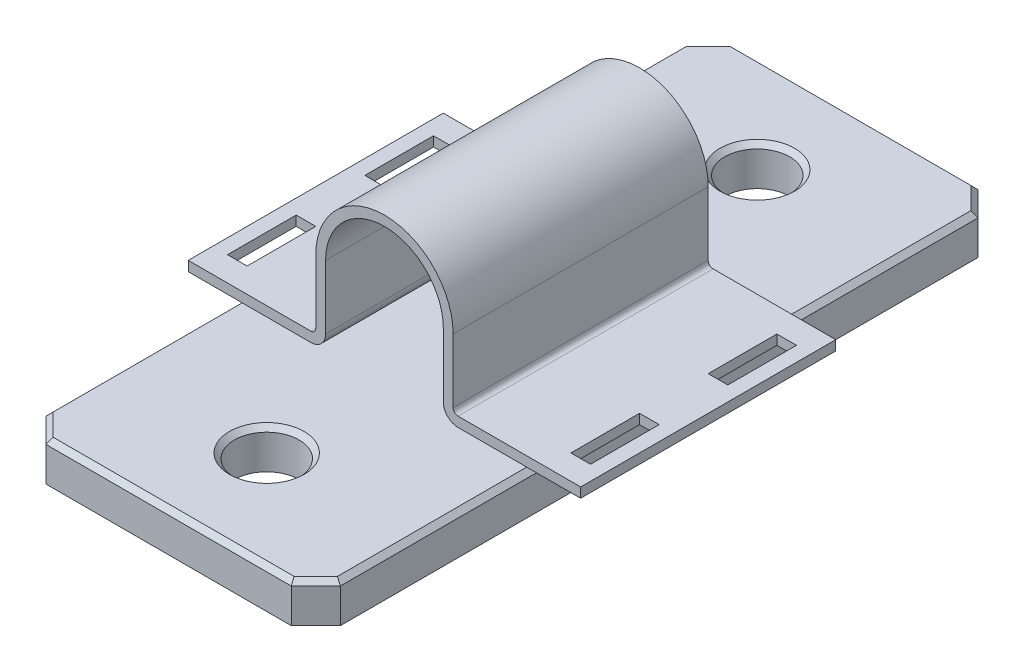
ISO-10303-21;
HEADER;
FILE_DESCRIPTION(('STEP AP214'),'2;1');
FILE_NAME('part.step','',(''),(''),'','','');
FILE_SCHEMA(('AUTOMOTIVE_DESIGN { 1 0 10303 214 1 1 1 1 }'));
ENDSEC;
DATA;
#1=APPLICATION_CONTEXT('core data for automotive mechanical design processes');
#2=APPLICATION_PROTOCOL_DEFINITION('international standard','automotive_design',2000,#1);
#3=PRODUCT_CONTEXT('',#1,'mechanical');
#4=PRODUCT('Part','Part','',(#3));
#5=PRODUCT_RELATED_PRODUCT_CATEGORY('part','',(#4));
#6=PRODUCT_DEFINITION_FORMATION('','',#4);
#7=PRODUCT_DEFINITION_CONTEXT('part definition',#1,'design');
#8=PRODUCT_DEFINITION('design','',#6,#7);
#9=PRODUCT_DEFINITION_SHAPE('','',#8);
#10=(LENGTH_UNIT() NAMED_UNIT(*) SI_UNIT(.MILLI.,.METRE.));
#11=(NAMED_UNIT(*) PLANE_ANGLE_UNIT() SI_UNIT($,.RADIAN.));
#12=(NAMED_UNIT(*) SI_UNIT($,.STERADIAN.) SOLID_ANGLE_UNIT());
#13=UNCERTAINTY_MEASURE_WITH_UNIT(LENGTH_MEASURE(1.E-05),#10,'distance_accuracy_value','');
#14=(GEOMETRIC_REPRESENTATION_CONTEXT(3) GLOBAL_UNCERTAINTY_ASSIGNED_CONTEXT((#13)) GLOBAL_UNIT_ASSIGNED_CONTEXT((#10,
#11,#12)) REPRESENTATION_CONTEXT('',''));
#15=CARTESIAN_POINT('',(0.,0.,0.));
#16=DIRECTION('',(0.,0.,1.));
#17=DIRECTION('',(1.,0.,0.));
#18=AXIS2_PLACEMENT_3D('',#15,#16,#17);
#19=CARTESIAN_POINT('',(-20.,5.,13.));
#20=DIRECTION('',(0.,1.,0.));
#21=DIRECTION('',(0.,0.,1.));
#22=AXIS2_PLACEMENT_3D('',#19,#20,#21);
#23=PLANE('',#22);
#24=DIRECTION('',(1.,0.,0.));
#25=VECTOR('',#24,1.);
#26=CARTESIAN_POINT('',(-20.,5.,-13.));
#27=LINE('',#26,#25);
#28=CARTESIAN_POINT('',(-20.,5.,-13.));
#29=VERTEX_POINT('',#28);
#30=CARTESIAN_POINT('',(-7.5,5.,-13.));
#31=VERTEX_POINT('',#30);
#32=EDGE_CURVE('E582',#29,#31,#27,.T.);
#33=ORIENTED_EDGE('',*,*,#32,.F.);
#34=DIRECTION('',(0.,0.,-1.));
#35=VECTOR('',#34,1.);
#36=CARTESIAN_POINT('',(-20.,5.,13.));
#37=LINE('',#36,#35);
#38=CARTESIAN_POINT('',(-20.,5.,13.));
#39=VERTEX_POINT('',#38);
#40=EDGE_CURVE('E626',#39,#29,#37,.T.);
#41=ORIENTED_EDGE('',*,*,#40,.F.);
#42=DIRECTION('',(1.,0.,0.));
#43=VECTOR('',#42,1.);
#44=CARTESIAN_POINT('',(-20.,5.,13.));
#45=LINE('',#44,#43);
#46=CARTESIAN_POINT('',(-7.5,5.,13.));
#47=VERTEX_POINT('',#46);
#48=EDGE_CURVE('E533',#39,#47,#45,.T.);
#49=ORIENTED_EDGE('',*,*,#48,.T.);
#50=DIRECTION('',(0.,0.,-1.));
#51=VECTOR('',#50,1.);
#52=CARTESIAN_POINT('',(-7.5,5.,13.));
#53=LINE('',#52,#51);
#54=EDGE_CURVE('E629',#47,#31,#53,.T.);
#55=ORIENTED_EDGE('',*,*,#54,.T.);
#56=EDGE_LOOP('',(#33,#41,#49,#55));
#57=FACE_BOUND('',#56,.T.);
#58=DIRECTION('',(1.,0.,0.));
#59=VECTOR('',#58,1.);
#60=CARTESIAN_POINT('',(-16.5,5.,3.5));
#61=LINE('',#60,#59);
#62=CARTESIAN_POINT('',(-18.5,5.,3.5));
#63=VERTEX_POINT('',#62);
#64=CARTESIAN_POINT('',(-16.5,5.,3.5));
#65=VERTEX_POINT('',#64);
#66=EDGE_CURVE('E416',#63,#65,#61,.T.);
#67=ORIENTED_EDGE('',*,*,#66,.T.);
#68=DIRECTION('',(0.,0.,1.));
#69=VECTOR('',#68,1.);
#70=CARTESIAN_POINT('',(-16.5,5.,3.5));
#71=LINE('',#70,#69);
#72=CARTESIAN_POINT('',(-16.5,5.,10.5));
#73=VERTEX_POINT('',#72);
#74=EDGE_CURVE('E412',#65,#73,#71,.T.);
#75=ORIENTED_EDGE('',*,*,#74,.T.);
#76=DIRECTION('',(-1.,0.,0.));
#77=VECTOR('',#76,1.);
#78=CARTESIAN_POINT('',(-16.5,5.,10.5));
#79=LINE('',#78,#77);
#80=CARTESIAN_POINT('',(-18.5,5.,10.5));
#81=VERTEX_POINT('',#80);
#82=EDGE_CURVE('E424',#73,#81,#79,.T.);
#83=ORIENTED_EDGE('',*,*,#82,.T.);
#84=DIRECTION('',(0.,0.,-1.));
#85=VECTOR('',#84,1.);
#86=CARTESIAN_POINT('',(-18.5,5.,3.5));
#87=LINE('',#86,#85);
#88=EDGE_CURVE('E420',#81,#63,#87,.T.);
#89=ORIENTED_EDGE('',*,*,#88,.T.);
#90=EDGE_LOOP('',(#67,#75,#83,#89));
#91=FACE_BOUND('',#90,.T.);
#92=DIRECTION('',(1.,0.,0.));
#93=VECTOR('',#92,1.);
#94=CARTESIAN_POINT('',(-16.5,5.,-10.5));
#95=LINE('',#94,#93);
#96=CARTESIAN_POINT('',(-18.5,5.,-10.5));
#97=VERTEX_POINT('',#96);
#98=CARTESIAN_POINT('',(-16.5,5.,-10.5));
#99=VERTEX_POINT('',#98);
#100=EDGE_CURVE('E379',#97,#99,#95,.T.);
#101=ORIENTED_EDGE('',*,*,#100,.T.);
#102=DIRECTION('',(0.,0.,1.));
#103=VECTOR('',#102,1.);
#104=CARTESIAN_POINT('',(-16.5,5.,-10.5));
#105=LINE('',#104,#103);
#106=CARTESIAN_POINT('',(-16.5,5.,-3.5));
#107=VERTEX_POINT('',#106);
#108=EDGE_CURVE('E57',#99,#107,#105,.T.);
#109=ORIENTED_EDGE('',*,*,#108,.T.);
#110=DIRECTION('',(-1.,0.,0.));
#111=VECTOR('',#110,1.);
#112=CARTESIAN_POINT('',(-16.5,5.,-3.5));
#113=LINE('',#112,#111);
#114=CARTESIAN_POINT('',(-18.5,5.,-3.5));
#115=VERTEX_POINT('',#114);
#116=EDGE_CURVE('E369',#107,#115,#113,.T.);
#117=ORIENTED_EDGE('',*,*,#116,.T.);
#118=DIRECTION('',(0.,0.,-1.));
#119=VECTOR('',#118,1.);
#120=CARTESIAN_POINT('',(-18.5,5.,-10.5));
#121=LINE('',#120,#119);
#122=EDGE_CURVE('E387',#115,#97,#121,.T.);
#123=ORIENTED_EDGE('',*,*,#122,.T.);
#124=EDGE_LOOP('',(#101,#109,#117,#123));
#125=FACE_BOUND('',#124,.T.);
#126=ADVANCED_FACE('F37',(#57,#91,#125),#23,.T.);
#127=CARTESIAN_POINT('',(-20.,4.,13.));
#128=DIRECTION('',(0.,1.,0.));
#129=DIRECTION('',(0.,0.,1.));
#130=AXIS2_PLACEMENT_3D('',#127,#128,#129);
#131=PLANE('',#130);
#132=DIRECTION('',(0.,0.,-1.));
#133=VECTOR('',#132,1.);
#134=CARTESIAN_POINT('',(-16.5,4.,3.5));
#135=LINE('',#134,#133);
#136=CARTESIAN_POINT('',(-16.5,4.,10.5));
#137=VERTEX_POINT('',#136);
#138=CARTESIAN_POINT('',(-16.5,4.,3.5));
#139=VERTEX_POINT('',#138);
#140=EDGE_CURVE('E408',#137,#139,#135,.T.);
#141=ORIENTED_EDGE('',*,*,#140,.T.);
#142=DIRECTION('',(-1.,0.,0.));
#143=VECTOR('',#142,1.);
#144=CARTESIAN_POINT('',(-16.5,4.,3.5));
#145=LINE('',#144,#143);
#146=CARTESIAN_POINT('',(-18.5,4.,3.5));
#147=VERTEX_POINT('',#146);
#148=EDGE_CURVE('E432',#139,#147,#145,.T.);
#149=ORIENTED_EDGE('',*,*,#148,.T.);
#150=DIRECTION('',(0.,0.,1.));
#151=VECTOR('',#150,1.);
#152=CARTESIAN_POINT('',(-18.5,4.,3.5));
#153=LINE('',#152,#151);
#154=CARTESIAN_POINT('',(-18.5,4.,10.5));
#155=VERTEX_POINT('',#154);
#156=EDGE_CURVE('E362',#147,#155,#153,.T.);
#157=ORIENTED_EDGE('',*,*,#156,.T.);
#158=DIRECTION('',(1.,0.,0.));
#159=VECTOR('',#158,1.);
#160=CARTESIAN_POINT('',(-16.5,4.,10.5));
#161=LINE('',#160,#159);
#162=EDGE_CURVE('E404',#155,#137,#161,.T.);
#163=ORIENTED_EDGE('',*,*,#162,.T.);
#164=EDGE_LOOP('',(#141,#149,#157,#163));
#165=FACE_BOUND('',#164,.T.);
#166=DIRECTION('',(0.,0.,1.));
#167=VECTOR('',#166,1.);
#168=CARTESIAN_POINT('',(-14.5,4.,32.5));
#169=LINE('',#168,#167);
#170=CARTESIAN_POINT('',(-14.5,4.,-13.));
#171=VERTEX_POINT('',#170);
#172=CARTESIAN_POINT('',(-14.5,4.,13.));
#173=VERTEX_POINT('',#172);
#174=EDGE_CURVE('E720',#171,#173,#169,.T.);
#175=ORIENTED_EDGE('',*,*,#174,.T.);
#176=DIRECTION('',(1.,0.,0.));
#177=VECTOR('',#176,1.);
#178=CARTESIAN_POINT('',(-20.,4.,13.));
#179=LINE('',#178,#177);
#180=CARTESIAN_POINT('',(-20.,4.,13.));
#181=VERTEX_POINT('',#180);
#182=EDGE_CURVE('E542',#181,#173,#179,.T.);
#183=ORIENTED_EDGE('',*,*,#182,.F.);
#184=DIRECTION('',(0.,0.,-1.));
#185=VECTOR('',#184,1.);
#186=CARTESIAN_POINT('',(-20.,4.,13.));
#187=LINE('',#186,#185);
#188=CARTESIAN_POINT('',(-20.,4.,-13.));
#189=VERTEX_POINT('',#188);
#190=EDGE_CURVE('E623',#181,#189,#187,.T.);
#191=ORIENTED_EDGE('',*,*,#190,.T.);
#192=DIRECTION('',(1.,0.,0.));
#193=VECTOR('',#192,1.);
#194=CARTESIAN_POINT('',(-20.,4.,-13.));
#195=LINE('',#194,#193);
#196=EDGE_CURVE('E591',#189,#171,#195,.T.);
#197=ORIENTED_EDGE('',*,*,#196,.T.);
#198=EDGE_LOOP('',(#175,#183,#191,#197));
#199=FACE_BOUND('',#198,.T.);
#200=DIRECTION('',(0.,0.,-1.));
#201=VECTOR('',#200,1.);
#202=CARTESIAN_POINT('',(-16.5,4.,-10.5));
#203=LINE('',#202,#201);
#204=CARTESIAN_POINT('',(-16.5,4.,-3.5));
#205=VERTEX_POINT('',#204);
#206=CARTESIAN_POINT('',(-16.5,4.,-10.5));
#207=VERTEX_POINT('',#206);
#208=EDGE_CURVE('E366',#205,#207,#203,.T.);
#209=ORIENTED_EDGE('',*,*,#208,.T.);
#210=DIRECTION('',(-1.,0.,0.));
#211=VECTOR('',#210,1.);
#212=CARTESIAN_POINT('',(-16.5,4.,-10.5));
#213=LINE('',#212,#211);
#214=CARTESIAN_POINT('',(-18.5,4.,-10.5));
#215=VERTEX_POINT('',#214);
#216=EDGE_CURVE('E354',#207,#215,#213,.T.);
#217=ORIENTED_EDGE('',*,*,#216,.T.);
#218=DIRECTION('',(0.,0.,1.));
#219=VECTOR('',#218,1.);
#220=CARTESIAN_POINT('',(-18.5,4.,-10.5));
#221=LINE('',#220,#219);
#222=CARTESIAN_POINT('',(-18.5,4.,-3.5));
#223=VERTEX_POINT('',#222);
#224=EDGE_CURVE('E381',#215,#223,#221,.T.);
#225=ORIENTED_EDGE('',*,*,#224,.T.);
#226=DIRECTION('',(1.,0.,0.));
#227=VECTOR('',#226,1.);
#228=CARTESIAN_POINT('',(-16.5,4.,-3.5));
#229=LINE('',#228,#227);
#230=EDGE_CURVE('E373',#223,#205,#229,.T.);
#231=ORIENTED_EDGE('',*,*,#230,.T.);
#232=EDGE_LOOP('',(#209,#217,#225,#231));
#233=FACE_BOUND('',#232,.T.);
#234=ADVANCED_FACE('F372',(#165,#199,#233),#131,.F.);
#235=CARTESIAN_POINT('',(-15.,4.,35.));
#236=DIRECTION('',(1.,0.,0.));
#237=DIRECTION('',(0.,0.,-1.));
#238=AXIS2_PLACEMENT_3D('',#235,#236,#237);
#239=PLANE('',#238);
#240=DIRECTION('',(0.,1.,0.));
#241=VECTOR('',#240,1.);
#242=CARTESIAN_POINT('',(-15.,4.,32.5));
#243=LINE('',#242,#241);
#244=CARTESIAN_POINT('',(-15.,0.,32.5));
#245=VERTEX_POINT('',#244);
#246=CARTESIAN_POINT('',(-15.,3.49999999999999,32.5));
#247=VERTEX_POINT('',#246);
#248=EDGE_CURVE('E686',#245,#247,#243,.T.);
#249=ORIENTED_EDGE('',*,*,#248,.T.);
#250=DIRECTION('',(0.,0.,-1.));
#251=VECTOR('',#250,1.);
#252=CARTESIAN_POINT('',(-15.,3.49999999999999,-32.5));
#253=LINE('',#252,#251);
#254=CARTESIAN_POINT('',(-15.,3.49999999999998,-32.5));
#255=VERTEX_POINT('',#254);
#256=EDGE_CURVE('E734',#247,#255,#253,.T.);
#257=ORIENTED_EDGE('',*,*,#256,.T.);
#258=DIRECTION('',(0.,-1.,0.));
#259=VECTOR('',#258,1.);
#260=CARTESIAN_POINT('',(-15.,4.,-32.5));
#261=LINE('',#260,#259);
#262=CARTESIAN_POINT('',(-15.,0.,-32.5));
#263=VERTEX_POINT('',#262);
#264=EDGE_CURVE('E690',#255,#263,#261,.T.);
#265=ORIENTED_EDGE('',*,*,#264,.T.);
#266=DIRECTION('',(0.,0.,1.));
#267=VECTOR('',#266,1.);
#268=CARTESIAN_POINT('',(-15.,0.,35.));
#269=LINE('',#268,#267);
#270=EDGE_CURVE('E654',#263,#245,#269,.T.);
#271=ORIENTED_EDGE('',*,*,#270,.T.);
#272=EDGE_LOOP('',(#249,#257,#265,#271));
#273=FACE_BOUND('',#272,.T.);
#274=ADVANCED_FACE('F796',(#273),#239,.F.);
#275=CARTESIAN_POINT('',(15.,4.,35.));
#276=DIRECTION('',(0.,0.,-1.));
#277=DIRECTION('',(-1.,0.,0.));
#278=AXIS2_PLACEMENT_3D('',#275,#276,#277);
#279=PLANE('',#278);
#280=DIRECTION('',(0.,1.,0.));
#281=VECTOR('',#280,1.);
#282=CARTESIAN_POINT('',(12.5,4.,35.));
#283=LINE('',#282,#281);
#284=CARTESIAN_POINT('',(12.5,0.,35.));
#285=VERTEX_POINT('',#284);
#286=CARTESIAN_POINT('',(12.5,3.49999999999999,35.));
#287=VERTEX_POINT('',#286);
#288=EDGE_CURVE('E692',#285,#287,#283,.T.);
#289=ORIENTED_EDGE('',*,*,#288,.T.);
#290=DIRECTION('',(-1.,0.,0.));
#291=VECTOR('',#290,1.);
#292=CARTESIAN_POINT('',(-12.5,3.49999999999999,35.));
#293=LINE('',#292,#291);
#294=CARTESIAN_POINT('',(-12.5,3.49999999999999,35.));
#295=VERTEX_POINT('',#294);
#296=EDGE_CURVE('E730',#287,#295,#293,.T.);
#297=ORIENTED_EDGE('',*,*,#296,.T.);
#298=DIRECTION('',(0.,-1.,0.));
#299=VECTOR('',#298,1.);
#300=CARTESIAN_POINT('',(-12.5,4.,35.));
#301=LINE('',#300,#299);
#302=CARTESIAN_POINT('',(-12.5,0.,35.));
#303=VERTEX_POINT('',#302);
#304=EDGE_CURVE('E695',#295,#303,#301,.T.);
#305=ORIENTED_EDGE('',*,*,#304,.T.);
#306=DIRECTION('',(1.,0.,0.));
#307=VECTOR('',#306,1.);
#308=CARTESIAN_POINT('',(15.,0.,35.));
#309=LINE('',#308,#307);
#310=EDGE_CURVE('E658',#303,#285,#309,.T.);
#311=ORIENTED_EDGE('',*,*,#310,.T.);
#312=EDGE_LOOP('',(#289,#297,#305,#311));
#313=FACE_BOUND('',#312,.T.);
#314=ADVANCED_FACE('F1357',(#313),#279,.F.);
#315=CARTESIAN_POINT('',(15.,4.,35.));
#316=DIRECTION('',(-1.,0.,0.));
#317=DIRECTION('',(0.,0.,1.));
#318=AXIS2_PLACEMENT_3D('',#315,#316,#317);
#319=PLANE('',#318);
#320=DIRECTION('',(0.,1.,0.));
#321=VECTOR('',#320,1.);
#322=CARTESIAN_POINT('',(15.,4.,-32.5));
#323=LINE('',#322,#321);
#324=CARTESIAN_POINT('',(15.,0.,-32.5));
#325=VERTEX_POINT('',#324);
#326=CARTESIAN_POINT('',(15.,3.49999999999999,-32.5));
#327=VERTEX_POINT('',#326);
#328=EDGE_CURVE('E683',#325,#327,#323,.T.);
#329=ORIENTED_EDGE('',*,*,#328,.T.);
#330=DIRECTION('',(0.,0.,1.));
#331=VECTOR('',#330,1.);
#332=CARTESIAN_POINT('',(15.,3.49999999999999,32.5));
#333=LINE('',#332,#331);
#334=CARTESIAN_POINT('',(15.,3.49999999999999,32.5));
#335=VERTEX_POINT('',#334);
#336=EDGE_CURVE('E743',#327,#335,#333,.T.);
#337=ORIENTED_EDGE('',*,*,#336,.T.);
#338=DIRECTION('',(0.,-1.,0.));
#339=VECTOR('',#338,1.);
#340=CARTESIAN_POINT('',(15.,4.,32.5));
#341=LINE('',#340,#339);
#342=CARTESIAN_POINT('',(15.,0.,32.5));
#343=VERTEX_POINT('',#342);
#344=EDGE_CURVE('E681',#335,#343,#341,.T.);
#345=ORIENTED_EDGE('',*,*,#344,.T.);
#346=DIRECTION('',(0.,0.,-1.));
#347=VECTOR('',#346,1.);
#348=CARTESIAN_POINT('',(15.,0.,35.));
#349=LINE('',#348,#347);
#350=EDGE_CURVE('E661',#343,#325,#349,.T.);
#351=ORIENTED_EDGE('',*,*,#350,.T.);
#352=EDGE_LOOP('',(#329,#337,#345,#351));
#353=FACE_BOUND('',#352,.T.);
#354=ADVANCED_FACE('F1349',(#353),#319,.F.);
#355=CARTESIAN_POINT('',(15.,4.,-35.));
#356=DIRECTION('',(0.,0.,1.));
#357=DIRECTION('',(1.,0.,0.));
#358=AXIS2_PLACEMENT_3D('',#355,#356,#357);
#359=PLANE('',#358);
#360=DIRECTION('',(0.,1.,0.));
#361=VECTOR('',#360,1.);
#362=CARTESIAN_POINT('',(-12.5,4.,-35.));
#363=LINE('',#362,#361);
#364=CARTESIAN_POINT('',(-12.5,0.,-35.));
#365=VERTEX_POINT('',#364);
#366=CARTESIAN_POINT('',(-12.5,3.49999999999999,-35.));
#367=VERTEX_POINT('',#366);
#368=EDGE_CURVE('E667',#365,#367,#363,.T.);
#369=ORIENTED_EDGE('',*,*,#368,.T.);
#370=DIRECTION('',(1.,0.,0.));
#371=VECTOR('',#370,1.);
#372=CARTESIAN_POINT('',(12.5,3.49999999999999,-35.));
#373=LINE('',#372,#371);
#374=CARTESIAN_POINT('',(12.5,3.49999999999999,-35.));
#375=VERTEX_POINT('',#374);
#376=EDGE_CURVE('E739',#367,#375,#373,.T.);
#377=ORIENTED_EDGE('',*,*,#376,.T.);
#378=DIRECTION('',(0.,-1.,0.));
#379=VECTOR('',#378,1.);
#380=CARTESIAN_POINT('',(12.5,4.,-35.));
#381=LINE('',#380,#379);
#382=CARTESIAN_POINT('',(12.5,0.,-35.));
#383=VERTEX_POINT('',#382);
#384=EDGE_CURVE('E670',#375,#383,#381,.T.);
#385=ORIENTED_EDGE('',*,*,#384,.T.);
#386=DIRECTION('',(-1.,0.,0.));
#387=VECTOR('',#386,1.);
#388=CARTESIAN_POINT('',(15.,0.,-35.));
#389=LINE('',#388,#387);
#390=EDGE_CURVE('E664',#383,#365,#389,.T.);
#391=ORIENTED_EDGE('',*,*,#390,.T.);
#392=EDGE_LOOP('',(#369,#377,#385,#391));
#393=FACE_BOUND('',#392,.T.);
#394=ADVANCED_FACE('F784',(#393),#359,.F.);
#395=CARTESIAN_POINT('',(0.,4.,0.));
#396=DIRECTION('',(0.,1.,0.));
#397=DIRECTION('',(0.,0.,1.));
#398=AXIS2_PLACEMENT_3D('',#395,#396,#397);
#399=PLANE('',#398);
#400=CARTESIAN_POINT('',(-7.5,4.,13.));
#401=VERTEX_POINT('',#400);
#402=EDGE_CURVE('E541',#173,#401,#179,.T.);
#403=ORIENTED_EDGE('',*,*,#402,.F.);
#404=CARTESIAN_POINT('',(-14.5,4.,32.2928932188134));
#405=VERTEX_POINT('',#404);
#406=EDGE_CURVE('E714',#173,#405,#169,.T.);
#407=ORIENTED_EDGE('',*,*,#406,.T.);
#408=DIRECTION('',(0.707106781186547,0.,0.707106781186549));
#409=VECTOR('',#408,1.);
#410=CARTESIAN_POINT('',(-23.3964466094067,4.,23.3964466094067));
#411=LINE('',#410,#409);
#412=CARTESIAN_POINT('',(-12.2928932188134,4.,34.5));
#413=VERTEX_POINT('',#412);
#414=EDGE_CURVE('E719',#405,#413,#411,.T.);
#415=ORIENTED_EDGE('',*,*,#414,.T.);
#416=DIRECTION('',(1.,0.,0.));
#417=VECTOR('',#416,1.);
#418=CARTESIAN_POINT('',(12.5,4.,34.5));
#419=LINE('',#418,#417);
#420=CARTESIAN_POINT('',(12.2928932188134,4.,34.5));
#421=VERTEX_POINT('',#420);
#422=EDGE_CURVE('E722',#413,#421,#419,.T.);
#423=ORIENTED_EDGE('',*,*,#422,.T.);
#424=DIRECTION('',(0.707106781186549,0.,-0.707106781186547));
#425=VECTOR('',#424,1.);
#426=CARTESIAN_POINT('',(23.3964466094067,4.,23.3964466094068));
#427=LINE('',#426,#425);
#428=CARTESIAN_POINT('',(14.5,4.,32.2928932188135));
#429=VERTEX_POINT('',#428);
#430=EDGE_CURVE('E724',#421,#429,#427,.T.);
#431=ORIENTED_EDGE('',*,*,#430,.T.);
#432=DIRECTION('',(0.,0.,-1.));
#433=VECTOR('',#432,1.);
#434=CARTESIAN_POINT('',(14.5,4.,-32.5));
#435=LINE('',#434,#433);
#436=CARTESIAN_POINT('',(14.5,4.,13.));
#437=VERTEX_POINT('',#436);
#438=EDGE_CURVE('E704',#429,#437,#435,.T.);
#439=ORIENTED_EDGE('',*,*,#438,.T.);
#440=DIRECTION('',(1.,0.,0.));
#441=VECTOR('',#440,1.);
#442=CARTESIAN_POINT('',(7.5,4.,13.));
#443=LINE('',#442,#441);
#444=CARTESIAN_POINT('',(7.5,4.,13.));
#445=VERTEX_POINT('',#444);
#446=EDGE_CURVE('E508',#445,#437,#443,.T.);
#447=ORIENTED_EDGE('',*,*,#446,.F.);
#448=DIRECTION('',(0.,0.,-1.));
#449=VECTOR('',#448,1.);
#450=CARTESIAN_POINT('',(7.5,4.,13.));
#451=LINE('',#450,#449);
#452=CARTESIAN_POINT('',(7.5,4.,-13.));
#453=VERTEX_POINT('',#452);
#454=EDGE_CURVE('E557',#445,#453,#451,.T.);
#455=ORIENTED_EDGE('',*,*,#454,.T.);
#456=DIRECTION('',(1.,0.,0.));
#457=VECTOR('',#456,1.);
#458=CARTESIAN_POINT('',(7.5,4.,-13.));
#459=LINE('',#458,#457);
#460=CARTESIAN_POINT('',(14.5,4.,-13.));
#461=VERTEX_POINT('',#460);
#462=EDGE_CURVE('E558',#453,#461,#459,.T.);
#463=ORIENTED_EDGE('',*,*,#462,.T.);
#464=CARTESIAN_POINT('',(14.5,4.,-32.2928932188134));
#465=VERTEX_POINT('',#464);
#466=EDGE_CURVE('E703',#461,#465,#435,.T.);
#467=ORIENTED_EDGE('',*,*,#466,.T.);
#468=DIRECTION('',(-0.707106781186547,0.,-0.707106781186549));
#469=VECTOR('',#468,1.);
#470=CARTESIAN_POINT('',(23.3964466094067,4.,-23.3964466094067));
#471=LINE('',#470,#469);
#472=CARTESIAN_POINT('',(12.2928932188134,4.,-34.5));
#473=VERTEX_POINT('',#472);
#474=EDGE_CURVE('E707',#465,#473,#471,.T.);
#475=ORIENTED_EDGE('',*,*,#474,.T.);
#476=DIRECTION('',(-1.,0.,0.));
#477=VECTOR('',#476,1.);
#478=CARTESIAN_POINT('',(-12.5,4.,-34.5));
#479=LINE('',#478,#477);
#480=CARTESIAN_POINT('',(-12.2928932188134,4.,-34.5));
#481=VERTEX_POINT('',#480);
#482=EDGE_CURVE('E710',#473,#481,#479,.T.);
#483=ORIENTED_EDGE('',*,*,#482,.T.);
#484=DIRECTION('',(-0.707106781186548,0.,0.707106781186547));
#485=VECTOR('',#484,1.);
#486=CARTESIAN_POINT('',(-23.3964466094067,4.,-23.3964466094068));
#487=LINE('',#486,#485);
#488=CARTESIAN_POINT('',(-14.5,4.,-32.2928932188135));
#489=VERTEX_POINT('',#488);
#490=EDGE_CURVE('E712',#481,#489,#487,.T.);
#491=ORIENTED_EDGE('',*,*,#490,.T.);
#492=EDGE_CURVE('E715',#489,#171,#169,.T.);
#493=ORIENTED_EDGE('',*,*,#492,.T.);
#494=CARTESIAN_POINT('',(-7.5,4.,-13.));
#495=VERTEX_POINT('',#494);
#496=EDGE_CURVE('E590',#171,#495,#195,.T.);
#497=ORIENTED_EDGE('',*,*,#496,.T.);
#498=DIRECTION('',(0.,0.,-1.));
#499=VECTOR('',#498,1.);
#500=CARTESIAN_POINT('',(-7.5,4.,13.));
#501=LINE('',#500,#499);
#502=EDGE_CURVE('E619',#401,#495,#501,.T.);
#503=ORIENTED_EDGE('',*,*,#502,.F.);
#504=EDGE_LOOP('',(#403,#407,#415,#423,#431,#439,#447,#455,#463,#467,#475,#483,#491,#493,#497,#503));
#505=FACE_BOUND('',#504,.T.);
#506=CARTESIAN_POINT('',(0.,4.,-25.));
#507=DIRECTION('',(0.,1.,0.));
#508=DIRECTION('',(0.,0.,1.));
#509=AXIS2_PLACEMENT_3D('',#506,#507,#508);
#510=CIRCLE('',#509,3.80000000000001);
#511=CARTESIAN_POINT('',(0.,4.,-21.2));
#512=VERTEX_POINT('',#511);
#513=EDGE_CURVE('E700',#512,#512,#510,.F.);
#514=ORIENTED_EDGE('',*,*,#513,.T.);
#515=EDGE_LOOP('',(#514));
#516=FACE_BOUND('',#515,.T.);
#517=CARTESIAN_POINT('',(0.,4.,25.));
#518=DIRECTION('',(0.,1.,0.));
#519=DIRECTION('',(0.,0.,1.));
#520=AXIS2_PLACEMENT_3D('',#517,#518,#519);
#521=CIRCLE('',#520,3.80000000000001);
#522=CARTESIAN_POINT('',(0.,4.,28.8));
#523=VERTEX_POINT('',#522);
#524=EDGE_CURVE('E697',#523,#523,#521,.F.);
#525=ORIENTED_EDGE('',*,*,#524,.T.);
#526=EDGE_LOOP('',(#525));
#527=FACE_BOUND('',#526,.T.);
#528=ADVANCED_FACE('F813',(#505,#516,#527),#399,.T.);
#529=CARTESIAN_POINT('',(0.,0.,0.));
#530=DIRECTION('',(0.,1.,0.));
#531=DIRECTION('',(0.,0.,1.));
#532=AXIS2_PLACEMENT_3D('',#529,#530,#531);
#533=PLANE('',#532);
#534=CARTESIAN_POINT('',(0.,0.,25.));
#535=DIRECTION('',(0.,1.,0.));
#536=DIRECTION('',(0.,0.,1.));
#537=AXIS2_PLACEMENT_3D('',#534,#535,#536);
#538=CIRCLE('',#537,3.3);
#539=CARTESIAN_POINT('',(0.,0.,28.3));
#540=VERTEX_POINT('',#539);
#541=EDGE_CURVE('E648',#540,#540,#538,.T.);
#542=ORIENTED_EDGE('',*,*,#541,.T.);
#543=EDGE_LOOP('',(#542));
#544=FACE_BOUND('',#543,.T.);
#545=CARTESIAN_POINT('',(0.,0.,-25.));
#546=DIRECTION('',(0.,1.,0.));
#547=DIRECTION('',(0.,0.,1.));
#548=AXIS2_PLACEMENT_3D('',#545,#546,#547);
#549=CIRCLE('',#548,3.3);
#550=CARTESIAN_POINT('',(0.,0.,-21.7));
#551=VERTEX_POINT('',#550);
#552=EDGE_CURVE('E651',#551,#551,#549,.T.);
#553=ORIENTED_EDGE('',*,*,#552,.T.);
#554=EDGE_LOOP('',(#553));
#555=FACE_BOUND('',#554,.T.);
#556=ORIENTED_EDGE('',*,*,#390,.F.);
#557=DIRECTION('',(-0.707106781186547,0.,-0.707106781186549));
#558=VECTOR('',#557,1.);
#559=CARTESIAN_POINT('',(12.5,0.,-35.));
#560=LINE('',#559,#558);
#561=EDGE_CURVE('E679',#383,#325,#560,.F.);
#562=ORIENTED_EDGE('',*,*,#561,.T.);
#563=ORIENTED_EDGE('',*,*,#350,.F.);
#564=DIRECTION('',(0.707106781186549,0.,-0.707106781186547));
#565=VECTOR('',#564,1.);
#566=CARTESIAN_POINT('',(15.,0.,32.5));
#567=LINE('',#566,#565);
#568=EDGE_CURVE('E672',#343,#285,#567,.F.);
#569=ORIENTED_EDGE('',*,*,#568,.T.);
#570=ORIENTED_EDGE('',*,*,#310,.F.);
#571=DIRECTION('',(0.707106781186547,0.,0.707106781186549));
#572=VECTOR('',#571,1.);
#573=CARTESIAN_POINT('',(-12.5,0.,35.));
#574=LINE('',#573,#572);
#575=EDGE_CURVE('E674',#303,#245,#574,.F.);
#576=ORIENTED_EDGE('',*,*,#575,.T.);
#577=ORIENTED_EDGE('',*,*,#270,.F.);
#578=DIRECTION('',(-0.707106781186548,0.,0.707106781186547));
#579=VECTOR('',#578,1.);
#580=CARTESIAN_POINT('',(-15.,0.,-32.5));
#581=LINE('',#580,#579);
#582=EDGE_CURVE('E677',#263,#365,#581,.F.);
#583=ORIENTED_EDGE('',*,*,#582,.T.);
#584=EDGE_LOOP('',(#556,#562,#563,#569,#570,#576,#577,#583));
#585=FACE_BOUND('',#584,.T.);
#586=ADVANCED_FACE('F789',(#544,#555,#585),#533,.F.);
#587=CARTESIAN_POINT('',(0.,4.,-25.));
#588=DIRECTION('',(0.,1.,0.));
#589=DIRECTION('',(0.,0.,1.));
#590=AXIS2_PLACEMENT_3D('',#587,#588,#589);
#591=CYLINDRICAL_SURFACE('',#590,3.3);
#592=CARTESIAN_POINT('',(0.,3.49999999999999,-25.));
#593=DIRECTION('',(0.,1.,0.));
#594=DIRECTION('',(0.,0.,1.));
#595=AXIS2_PLACEMENT_3D('',#592,#593,#594);
#596=CIRCLE('',#595,3.3);
#597=CARTESIAN_POINT('',(0.,3.49999999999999,-21.7));
#598=VERTEX_POINT('',#597);
#599=EDGE_CURVE('E46',#598,#598,#596,.T.);
#600=ORIENTED_EDGE('',*,*,#599,.T.);
#601=EDGE_LOOP('',(#600));
#602=FACE_BOUND('',#601,.T.);
#603=ORIENTED_EDGE('',*,*,#552,.F.);
#604=EDGE_LOOP('',(#603));
#605=FACE_BOUND('',#604,.T.);
#606=ADVANCED_FACE('F1317',(#602,#605),#591,.F.);
#607=CARTESIAN_POINT('',(0.,4.,25.));
#608=DIRECTION('',(0.,1.,0.));
#609=DIRECTION('',(0.,0.,1.));
#610=AXIS2_PLACEMENT_3D('',#607,#608,#609);
#611=CYLINDRICAL_SURFACE('',#610,3.3);
#612=CARTESIAN_POINT('',(0.,3.49999999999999,25.));
#613=DIRECTION('',(0.,1.,0.));
#614=DIRECTION('',(0.,0.,1.));
#615=AXIS2_PLACEMENT_3D('',#612,#613,#614);
#616=CIRCLE('',#615,3.3);
#617=CARTESIAN_POINT('',(0.,3.49999999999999,28.3));
#618=VERTEX_POINT('',#617);
#619=EDGE_CURVE('E11',#618,#618,#616,.T.);
#620=ORIENTED_EDGE('',*,*,#619,.T.);
#621=EDGE_LOOP('',(#620));
#622=FACE_BOUND('',#621,.T.);
#623=ORIENTED_EDGE('',*,*,#541,.F.);
#624=EDGE_LOOP('',(#623));
#625=FACE_BOUND('',#624,.T.);
#626=ADVANCED_FACE('F1308',(#622,#625),#611,.F.);
#627=CARTESIAN_POINT('',(12.5,4.,-35.));
#628=DIRECTION('',(-0.707106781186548,0.,0.707106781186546));
#629=DIRECTION('',(0.,-1.,0.));
#630=AXIS2_PLACEMENT_3D('',#627,#628,#629);
#631=PLANE('',#630);
#632=ORIENTED_EDGE('',*,*,#384,.F.);
#633=DIRECTION('',(-0.707106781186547,0.,-0.707106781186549));
#634=VECTOR('',#633,1.);
#635=CARTESIAN_POINT('',(12.5,3.49999999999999,-35.));
#636=LINE('',#635,#634);
#637=EDGE_CURVE('E741',#375,#327,#636,.F.);
#638=ORIENTED_EDGE('',*,*,#637,.T.);
#639=ORIENTED_EDGE('',*,*,#328,.F.);
#640=ORIENTED_EDGE('',*,*,#561,.F.);
#641=EDGE_LOOP('',(#632,#638,#639,#640));
#642=FACE_BOUND('',#641,.T.);
#643=ADVANCED_FACE('F1300',(#642),#631,.F.);
#644=CARTESIAN_POINT('',(-15.,4.,-32.5));
#645=DIRECTION('',(0.707106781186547,0.,0.707106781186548));
#646=DIRECTION('',(0.,-1.,0.));
#647=AXIS2_PLACEMENT_3D('',#644,#645,#646);
#648=PLANE('',#647);
#649=ORIENTED_EDGE('',*,*,#264,.F.);
#650=DIRECTION('',(-0.707106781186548,0.,0.707106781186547));
#651=VECTOR('',#650,1.);
#652=CARTESIAN_POINT('',(-15.,3.49999999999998,-32.5));
#653=LINE('',#652,#651);
#654=EDGE_CURVE('E737',#255,#367,#653,.F.);
#655=ORIENTED_EDGE('',*,*,#654,.T.);
#656=ORIENTED_EDGE('',*,*,#368,.F.);
#657=ORIENTED_EDGE('',*,*,#582,.F.);
#658=EDGE_LOOP('',(#649,#655,#656,#657));
#659=FACE_BOUND('',#658,.T.);
#660=ADVANCED_FACE('F781',(#659),#648,.F.);
#661=CARTESIAN_POINT('',(-12.5,4.,35.));
#662=DIRECTION('',(0.707106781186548,0.,-0.707106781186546));
#663=DIRECTION('',(0.,-1.,0.));
#664=AXIS2_PLACEMENT_3D('',#661,#662,#663);
#665=PLANE('',#664);
#666=ORIENTED_EDGE('',*,*,#304,.F.);
#667=DIRECTION('',(0.707106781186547,0.,0.707106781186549));
#668=VECTOR('',#667,1.);
#669=CARTESIAN_POINT('',(-12.5,3.49999999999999,35.));
#670=LINE('',#669,#668);
#671=EDGE_CURVE('E732',#295,#247,#670,.F.);
#672=ORIENTED_EDGE('',*,*,#671,.T.);
#673=ORIENTED_EDGE('',*,*,#248,.F.);
#674=ORIENTED_EDGE('',*,*,#575,.F.);
#675=EDGE_LOOP('',(#666,#672,#673,#674));
#676=FACE_BOUND('',#675,.T.);
#677=ADVANCED_FACE('F799',(#676),#665,.F.);
#678=CARTESIAN_POINT('',(15.,4.,32.5));
#679=DIRECTION('',(-0.707106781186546,0.,-0.707106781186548));
#680=DIRECTION('',(0.,-1.,0.));
#681=AXIS2_PLACEMENT_3D('',#678,#679,#680);
#682=PLANE('',#681);
#683=ORIENTED_EDGE('',*,*,#344,.F.);
#684=DIRECTION('',(0.707106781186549,0.,-0.707106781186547));
#685=VECTOR('',#684,1.);
#686=CARTESIAN_POINT('',(15.,3.49999999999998,32.5));
#687=LINE('',#686,#685);
#688=EDGE_CURVE('E727',#335,#287,#687,.F.);
#689=ORIENTED_EDGE('',*,*,#688,.T.);
#690=ORIENTED_EDGE('',*,*,#288,.F.);
#691=ORIENTED_EDGE('',*,*,#568,.F.);
#692=EDGE_LOOP('',(#683,#689,#690,#691));
#693=FACE_BOUND('',#692,.T.);
#694=ADVANCED_FACE('F1277',(#693),#682,.F.);
#695=CARTESIAN_POINT('',(-23.3964466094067,4.,-23.3964466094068));
#696=DIRECTION('',(-0.500000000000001,0.707106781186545,-0.500000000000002));
#697=DIRECTION('',(0.707106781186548,0.,-0.707106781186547));
#698=AXIS2_PLACEMENT_3D('',#695,#696,#697);
#699=PLANE('',#698);
#700=DIRECTION('',(0.281084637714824,0.678598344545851,0.678598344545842));
#701=VECTOR('',#700,1.);
#702=CARTESIAN_POINT('',(-11.3216492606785,6.34479033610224,-32.1552096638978));
#703=LINE('',#702,#701);
#704=EDGE_CURVE('E761',#367,#481,#703,.T.);
#705=ORIENTED_EDGE('',*,*,#704,.F.);
#706=ORIENTED_EDGE('',*,*,#654,.F.);
#707=DIRECTION('',(0.678598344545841,0.678598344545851,0.281084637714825));
#708=VECTOR('',#707,1.);
#709=CARTESIAN_POINT('',(-16.8998355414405,1.60016445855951,-33.2869376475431));
#710=LINE('',#709,#708);
#711=EDGE_CURVE('E41',#489,#255,#710,.F.);
#712=ORIENTED_EDGE('',*,*,#711,.F.);
#713=ORIENTED_EDGE('',*,*,#490,.F.);
#714=EDGE_LOOP('',(#705,#706,#712,#713));
#715=FACE_BOUND('',#714,.T.);
#716=ADVANCED_FACE('F777',(#715),#699,.T.);
#717=CARTESIAN_POINT('',(-14.5,4.,0.));
#718=DIRECTION('',(-0.707106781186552,0.707106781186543,0.));
#719=DIRECTION('',(0.,0.,-1.));
#720=AXIS2_PLACEMENT_3D('',#717,#718,#719);
#721=PLANE('',#720);
#722=ORIENTED_EDGE('',*,*,#711,.T.);
#723=ORIENTED_EDGE('',*,*,#256,.F.);
#724=DIRECTION('',(0.678598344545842,0.678598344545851,-0.281084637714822));
#725=VECTOR('',#724,1.);
#726=CARTESIAN_POINT('',(-8.34033826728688,10.1596617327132,29.7414777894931));
#727=LINE('',#726,#725);
#728=EDGE_CURVE('E759',#405,#247,#727,.F.);
#729=ORIENTED_EDGE('',*,*,#728,.F.);
#730=ORIENTED_EDGE('',*,*,#406,.F.);
#731=ORIENTED_EDGE('',*,*,#174,.F.);
#732=ORIENTED_EDGE('',*,*,#492,.F.);
#733=EDGE_LOOP('',(#722,#723,#729,#730,#731,#732));
#734=FACE_BOUND('',#733,.T.);
#735=ADVANCED_FACE('F772',(#734),#721,.T.);
#736=CARTESIAN_POINT('',(0.,4.,-34.5));
#737=DIRECTION('',(0.,0.707106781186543,-0.707106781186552));
#738=DIRECTION('',(1.,0.,0.));
#739=AXIS2_PLACEMENT_3D('',#736,#737,#738);
#740=PLANE('',#739);
#741=ORIENTED_EDGE('',*,*,#704,.T.);
#742=ORIENTED_EDGE('',*,*,#482,.F.);
#743=DIRECTION('',(-0.281084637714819,0.678598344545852,0.678598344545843));
#744=VECTOR('',#743,1.);
#745=CARTESIAN_POINT('',(11.0522377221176,6.99520732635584,-31.5047926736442));
#746=LINE('',#745,#744);
#747=EDGE_CURVE('E756',#375,#473,#746,.T.);
#748=ORIENTED_EDGE('',*,*,#747,.F.);
#749=ORIENTED_EDGE('',*,*,#376,.F.);
#750=EDGE_LOOP('',(#741,#742,#748,#749));
#751=FACE_BOUND('',#750,.T.);
#752=ADVANCED_FACE('F1256',(#751),#740,.T.);
#753=CARTESIAN_POINT('',(-23.3964466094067,4.,23.3964466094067));
#754=DIRECTION('',(-0.500000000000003,0.707106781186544,0.500000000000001));
#755=DIRECTION('',(-0.707106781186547,0.,-0.707106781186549));
#756=AXIS2_PLACEMENT_3D('',#753,#754,#755);
#757=PLANE('',#756);
#758=ORIENTED_EDGE('',*,*,#728,.T.);
#759=ORIENTED_EDGE('',*,*,#671,.F.);
#760=DIRECTION('',(0.281084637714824,0.678598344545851,-0.678598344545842));
#761=VECTOR('',#760,1.);
#762=CARTESIAN_POINT('',(-11.0522377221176,6.99520732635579,31.5047926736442));
#763=LINE('',#762,#761);
#764=EDGE_CURVE('E753',#413,#295,#763,.F.);
#765=ORIENTED_EDGE('',*,*,#764,.F.);
#766=ORIENTED_EDGE('',*,*,#414,.F.);
#767=EDGE_LOOP('',(#758,#759,#765,#766));
#768=FACE_BOUND('',#767,.T.);
#769=ADVANCED_FACE('F803',(#768),#757,.T.);
#770=CARTESIAN_POINT('',(23.3964466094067,4.,-23.3964466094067));
#771=DIRECTION('',(0.500000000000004,0.707106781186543,-0.500000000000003));
#772=DIRECTION('',(0.707106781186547,0.,0.707106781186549));
#773=AXIS2_PLACEMENT_3D('',#770,#771,#772);
#774=PLANE('',#773);
#775=ORIENTED_EDGE('',*,*,#747,.T.);
#776=ORIENTED_EDGE('',*,*,#474,.F.);
#777=DIRECTION('',(-0.678598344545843,0.678598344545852,0.281084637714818));
#778=VECTOR('',#777,1.);
#779=CARTESIAN_POINT('',(8.34033826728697,10.1596617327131,-29.7414777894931));
#780=LINE('',#779,#778);
#781=EDGE_CURVE('E750',#327,#465,#780,.T.);
#782=ORIENTED_EDGE('',*,*,#781,.F.);
#783=ORIENTED_EDGE('',*,*,#637,.F.);
#784=EDGE_LOOP('',(#775,#776,#782,#783));
#785=FACE_BOUND('',#784,.T.);
#786=ADVANCED_FACE('F1240',(#785),#774,.T.);
#787=CARTESIAN_POINT('',(0.,4.,34.5));
#788=DIRECTION('',(0.,0.707106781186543,0.707106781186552));
#789=DIRECTION('',(-1.,0.,0.));
#790=AXIS2_PLACEMENT_3D('',#787,#788,#789);
#791=PLANE('',#790);
#792=ORIENTED_EDGE('',*,*,#764,.T.);
#793=ORIENTED_EDGE('',*,*,#296,.F.);
#794=DIRECTION('',(-0.281084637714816,0.678598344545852,-0.678598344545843));
#795=VECTOR('',#794,1.);
#796=CARTESIAN_POINT('',(11.3216492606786,6.34479033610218,32.1552096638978));
#797=LINE('',#796,#795);
#798=EDGE_CURVE('E748',#421,#287,#797,.F.);
#799=ORIENTED_EDGE('',*,*,#798,.F.);
#800=ORIENTED_EDGE('',*,*,#422,.F.);
#801=EDGE_LOOP('',(#792,#793,#799,#800));
#802=FACE_BOUND('',#801,.T.);
#803=ADVANCED_FACE('F808',(#802),#791,.T.);
#804=CARTESIAN_POINT('',(14.5,4.,0.));
#805=DIRECTION('',(0.707106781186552,0.707106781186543,0.));
#806=DIRECTION('',(0.,0.,1.));
#807=AXIS2_PLACEMENT_3D('',#804,#805,#806);
#808=PLANE('',#807);
#809=ORIENTED_EDGE('',*,*,#781,.T.);
#810=ORIENTED_EDGE('',*,*,#466,.F.);
#811=EDGE_CURVE('E708',#437,#461,#435,.T.);
#812=ORIENTED_EDGE('',*,*,#811,.F.);
#813=ORIENTED_EDGE('',*,*,#438,.F.);
#814=DIRECTION('',(0.678598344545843,-0.678598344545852,0.281084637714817));
#815=VECTOR('',#814,1.);
#816=CARTESIAN_POINT('',(8.34033826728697,10.1596617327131,29.7414777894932));
#817=LINE('',#816,#815);
#818=EDGE_CURVE('E647',#335,#429,#817,.F.);
#819=ORIENTED_EDGE('',*,*,#818,.F.);
#820=ORIENTED_EDGE('',*,*,#336,.F.);
#821=EDGE_LOOP('',(#809,#810,#812,#813,#819,#820));
#822=FACE_BOUND('',#821,.T.);
#823=ADVANCED_FACE('F1224',(#822),#808,.T.);
#824=CARTESIAN_POINT('',(23.3964466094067,4.,23.3964466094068));
#825=DIRECTION('',(0.500000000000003,0.707106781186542,0.500000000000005));
#826=DIRECTION('',(-0.707106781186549,0.,0.707106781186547));
#827=AXIS2_PLACEMENT_3D('',#824,#825,#826);
#828=PLANE('',#827);
#829=ORIENTED_EDGE('',*,*,#798,.T.);
#830=ORIENTED_EDGE('',*,*,#688,.F.);
#831=ORIENTED_EDGE('',*,*,#818,.T.);
#832=ORIENTED_EDGE('',*,*,#430,.F.);
#833=EDGE_LOOP('',(#829,#830,#831,#832));
#834=FACE_BOUND('',#833,.T.);
#835=ADVANCED_FACE('F1216',(#834),#828,.T.);
#836=CARTESIAN_POINT('',(0.,3.49999999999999,-25.));
#837=DIRECTION('',(0.,1.,0.));
#838=DIRECTION('',(0.,0.,1.));
#839=AXIS2_PLACEMENT_3D('',#836,#837,#838);
#840=CONICAL_SURFACE('',#839,3.3,0.785398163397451);
#841=ORIENTED_EDGE('',*,*,#513,.F.);
#842=EDGE_LOOP('',(#841));
#843=FACE_BOUND('',#842,.T.);
#844=ORIENTED_EDGE('',*,*,#599,.F.);
#845=EDGE_LOOP('',(#844));
#846=FACE_BOUND('',#845,.T.);
#847=ADVANCED_FACE('F1207',(#843,#846),#840,.F.);
#848=CARTESIAN_POINT('',(0.,3.49999999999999,25.));
#849=DIRECTION('',(0.,1.,0.));
#850=DIRECTION('',(0.,0.,1.));
#851=AXIS2_PLACEMENT_3D('',#848,#849,#850);
#852=CONICAL_SURFACE('',#851,3.3,0.785398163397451);
#853=ORIENTED_EDGE('',*,*,#524,.F.);
#854=EDGE_LOOP('',(#853));
#855=FACE_BOUND('',#854,.T.);
#856=ORIENTED_EDGE('',*,*,#619,.F.);
#857=EDGE_LOOP('',(#856));
#858=FACE_BOUND('',#857,.T.);
#859=ADVANCED_FACE('F39',(#855,#858),#852,.F.);
#860=CARTESIAN_POINT('',(7.5,4.,13.));
#861=DIRECTION('',(0.,1.,0.));
#862=DIRECTION('',(0.,0.,1.));
#863=AXIS2_PLACEMENT_3D('',#860,#861,#862);
#864=PLANE('',#863);
#865=DIRECTION('',(1.,0.,0.));
#866=VECTOR('',#865,1.);
#867=CARTESIAN_POINT('',(16.5,4.,-10.5));
#868=LINE('',#867,#866);
#869=CARTESIAN_POINT('',(16.5,4.,-10.5));
#870=VERTEX_POINT('',#869);
#871=CARTESIAN_POINT('',(18.5,4.,-10.5));
#872=VERTEX_POINT('',#871);
#873=EDGE_CURVE('E447',#870,#872,#868,.T.);
#874=ORIENTED_EDGE('',*,*,#873,.F.);
#875=DIRECTION('',(0.,0.,-1.));
#876=VECTOR('',#875,1.);
#877=CARTESIAN_POINT('',(16.5,4.,-10.5));
#878=LINE('',#877,#876);
#879=CARTESIAN_POINT('',(16.5,4.,-3.5));
#880=VERTEX_POINT('',#879);
#881=EDGE_CURVE('E450',#880,#870,#878,.T.);
#882=ORIENTED_EDGE('',*,*,#881,.F.);
#883=DIRECTION('',(-1.,0.,0.));
#884=VECTOR('',#883,1.);
#885=CARTESIAN_POINT('',(16.5,4.,-3.5));
#886=LINE('',#885,#884);
#887=CARTESIAN_POINT('',(18.5,4.,-3.5));
#888=VERTEX_POINT('',#887);
#889=EDGE_CURVE('E467',#888,#880,#886,.T.);
#890=ORIENTED_EDGE('',*,*,#889,.F.);
#891=DIRECTION('',(0.,0.,1.));
#892=VECTOR('',#891,1.);
#893=CARTESIAN_POINT('',(18.5,4.,-10.5));
#894=LINE('',#893,#892);
#895=EDGE_CURVE('E445',#872,#888,#894,.T.);
#896=ORIENTED_EDGE('',*,*,#895,.F.);
#897=EDGE_LOOP('',(#874,#882,#890,#896));
#898=FACE_BOUND('',#897,.T.);
#899=DIRECTION('',(1.,0.,0.));
#900=VECTOR('',#899,1.);
#901=CARTESIAN_POINT('',(16.5,4.,3.5));
#902=LINE('',#901,#900);
#903=CARTESIAN_POINT('',(16.5,4.,3.5));
#904=VERTEX_POINT('',#903);
#905=CARTESIAN_POINT('',(18.5,4.,3.5));
#906=VERTEX_POINT('',#905);
#907=EDGE_CURVE('E478',#904,#906,#902,.T.);
#908=ORIENTED_EDGE('',*,*,#907,.F.);
#909=DIRECTION('',(0.,0.,-1.));
#910=VECTOR('',#909,1.);
#911=CARTESIAN_POINT('',(16.5,4.,3.5));
#912=LINE('',#911,#910);
#913=CARTESIAN_POINT('',(16.5,4.,10.5));
#914=VERTEX_POINT('',#913);
#915=EDGE_CURVE('E481',#914,#904,#912,.T.);
#916=ORIENTED_EDGE('',*,*,#915,.F.);
#917=DIRECTION('',(-1.,0.,0.));
#918=VECTOR('',#917,1.);
#919=CARTESIAN_POINT('',(16.5,4.,10.5));
#920=LINE('',#919,#918);
#921=CARTESIAN_POINT('',(18.5,4.,10.5));
#922=VERTEX_POINT('',#921);
#923=EDGE_CURVE('E498',#922,#914,#920,.T.);
#924=ORIENTED_EDGE('',*,*,#923,.F.);
#925=DIRECTION('',(0.,0.,1.));
#926=VECTOR('',#925,1.);
#927=CARTESIAN_POINT('',(18.5,4.,3.5));
#928=LINE('',#927,#926);
#929=EDGE_CURVE('E476',#906,#922,#928,.T.);
#930=ORIENTED_EDGE('',*,*,#929,.F.);
#931=EDGE_LOOP('',(#908,#916,#924,#930));
#932=FACE_BOUND('',#931,.T.);
#933=ORIENTED_EDGE('',*,*,#811,.T.);
#934=CARTESIAN_POINT('',(20.,4.,-13.));
#935=VERTEX_POINT('',#934);
#936=EDGE_CURVE('E507',#461,#935,#459,.T.);
#937=ORIENTED_EDGE('',*,*,#936,.T.);
#938=DIRECTION('',(0.,0.,-1.));
#939=VECTOR('',#938,1.);
#940=CARTESIAN_POINT('',(20.,4.,13.));
#941=LINE('',#940,#939);
#942=CARTESIAN_POINT('',(20.,4.,13.));
#943=VERTEX_POINT('',#942);
#944=EDGE_CURVE('E644',#943,#935,#941,.T.);
#945=ORIENTED_EDGE('',*,*,#944,.F.);
#946=EDGE_CURVE('E512',#437,#943,#443,.T.);
#947=ORIENTED_EDGE('',*,*,#946,.F.);
#948=EDGE_LOOP('',(#933,#937,#945,#947));
#949=FACE_BOUND('',#948,.T.);
#950=ADVANCED_FACE('F868',(#898,#932,#949),#864,.F.);
#951=CARTESIAN_POINT('',(20.,5.,13.));
#952=DIRECTION('',(1.,0.,0.));
#953=DIRECTION('',(0.,0.,-1.));
#954=AXIS2_PLACEMENT_3D('',#951,#952,#953);
#955=PLANE('',#954);
#956=DIRECTION('',(0.,-1.,0.));
#957=VECTOR('',#956,1.);
#958=CARTESIAN_POINT('',(20.,5.,-13.));
#959=LINE('',#958,#957);
#960=CARTESIAN_POINT('',(20.,5.,-13.));
#961=VERTEX_POINT('',#960);
#962=EDGE_CURVE('E561',#961,#935,#959,.T.);
#963=ORIENTED_EDGE('',*,*,#962,.F.);
#964=DIRECTION('',(0.,0.,-1.));
#965=VECTOR('',#964,1.);
#966=CARTESIAN_POINT('',(20.,5.,13.));
#967=LINE('',#966,#965);
#968=CARTESIAN_POINT('',(20.,5.,13.));
#969=VERTEX_POINT('',#968);
#970=EDGE_CURVE('E642',#969,#961,#967,.T.);
#971=ORIENTED_EDGE('',*,*,#970,.F.);
#972=DIRECTION('',(0.,-1.,0.));
#973=VECTOR('',#972,1.);
#974=CARTESIAN_POINT('',(20.,5.,13.));
#975=LINE('',#974,#973);
#976=EDGE_CURVE('E511',#969,#943,#975,.T.);
#977=ORIENTED_EDGE('',*,*,#976,.T.);
#978=ORIENTED_EDGE('',*,*,#944,.T.);
#979=EDGE_LOOP('',(#963,#971,#977,#978));
#980=FACE_BOUND('',#979,.T.);
#981=ADVANCED_FACE('F898',(#980),#955,.T.);
#982=CARTESIAN_POINT('',(7.5,5.,13.));
#983=DIRECTION('',(0.,1.,0.));
#984=DIRECTION('',(0.,0.,1.));
#985=AXIS2_PLACEMENT_3D('',#982,#983,#984);
#986=PLANE('',#985);
#987=DIRECTION('',(0.,0.,1.));
#988=VECTOR('',#987,1.);
#989=CARTESIAN_POINT('',(16.5,5.,-10.5));
#990=LINE('',#989,#988);
#991=CARTESIAN_POINT('',(16.5,5.,-10.5));
#992=VERTEX_POINT('',#991);
#993=CARTESIAN_POINT('',(16.5,5.,-3.5));
#994=VERTEX_POINT('',#993);
#995=EDGE_CURVE('E453',#992,#994,#990,.T.);
#996=ORIENTED_EDGE('',*,*,#995,.F.);
#997=DIRECTION('',(-1.,0.,0.));
#998=VECTOR('',#997,1.);
#999=CARTESIAN_POINT('',(16.5,5.,-10.5));
#1000=LINE('',#999,#998);
#1001=CARTESIAN_POINT('',(18.5,5.,-10.5));
#1002=VERTEX_POINT('',#1001);
#1003=EDGE_CURVE('E461',#1002,#992,#1000,.T.);
#1004=ORIENTED_EDGE('',*,*,#1003,.F.);
#1005=DIRECTION('',(0.,0.,-1.));
#1006=VECTOR('',#1005,1.);
#1007=CARTESIAN_POINT('',(18.5,5.,-10.5));
#1008=LINE('',#1007,#1006);
#1009=CARTESIAN_POINT('',(18.5,5.,-3.5));
#1010=VERTEX_POINT('',#1009);
#1011=EDGE_CURVE('E458',#1010,#1002,#1008,.T.);
#1012=ORIENTED_EDGE('',*,*,#1011,.F.);
#1013=DIRECTION('',(1.,0.,0.));
#1014=VECTOR('',#1013,1.);
#1015=CARTESIAN_POINT('',(16.5,5.,-3.5));
#1016=LINE('',#1015,#1014);
#1017=EDGE_CURVE('E455',#994,#1010,#1016,.T.);
#1018=ORIENTED_EDGE('',*,*,#1017,.F.);
#1019=EDGE_LOOP('',(#996,#1004,#1012,#1018));
#1020=FACE_BOUND('',#1019,.T.);
#1021=DIRECTION('',(0.,0.,1.));
#1022=VECTOR('',#1021,1.);
#1023=CARTESIAN_POINT('',(16.5,5.,3.5));
#1024=LINE('',#1023,#1022);
#1025=CARTESIAN_POINT('',(16.5,5.,3.5));
#1026=VERTEX_POINT('',#1025);
#1027=CARTESIAN_POINT('',(16.5,5.,10.5));
#1028=VERTEX_POINT('',#1027);
#1029=EDGE_CURVE('E484',#1026,#1028,#1024,.T.);
#1030=ORIENTED_EDGE('',*,*,#1029,.F.);
#1031=DIRECTION('',(-1.,0.,0.));
#1032=VECTOR('',#1031,1.);
#1033=CARTESIAN_POINT('',(16.5,5.,3.5));
#1034=LINE('',#1033,#1032);
#1035=CARTESIAN_POINT('',(18.5,5.,3.5));
#1036=VERTEX_POINT('',#1035);
#1037=EDGE_CURVE('E492',#1036,#1026,#1034,.T.);
#1038=ORIENTED_EDGE('',*,*,#1037,.F.);
#1039=DIRECTION('',(0.,0.,-1.));
#1040=VECTOR('',#1039,1.);
#1041=CARTESIAN_POINT('',(18.5,5.,3.5));
#1042=LINE('',#1041,#1040);
#1043=CARTESIAN_POINT('',(18.5,5.,10.5));
#1044=VERTEX_POINT('',#1043);
#1045=EDGE_CURVE('E489',#1044,#1036,#1042,.T.);
#1046=ORIENTED_EDGE('',*,*,#1045,.F.);
#1047=DIRECTION('',(1.,0.,0.));
#1048=VECTOR('',#1047,1.);
#1049=CARTESIAN_POINT('',(16.5,5.,10.5));
#1050=LINE('',#1049,#1048);
#1051=EDGE_CURVE('E486',#1028,#1044,#1050,.T.);
#1052=ORIENTED_EDGE('',*,*,#1051,.F.);
#1053=EDGE_LOOP('',(#1030,#1038,#1046,#1052));
#1054=FACE_BOUND('',#1053,.T.);
#1055=DIRECTION('',(1.,0.,0.));
#1056=VECTOR('',#1055,1.);
#1057=CARTESIAN_POINT('',(7.5,5.,-13.));
#1058=LINE('',#1057,#1056);
#1059=CARTESIAN_POINT('',(7.5,5.,-13.));
#1060=VERTEX_POINT('',#1059);
#1061=EDGE_CURVE('E564',#1060,#961,#1058,.T.);
#1062=ORIENTED_EDGE('',*,*,#1061,.F.);
#1063=DIRECTION('',(0.,0.,-1.));
#1064=VECTOR('',#1063,1.);
#1065=CARTESIAN_POINT('',(7.5,5.,13.));
#1066=LINE('',#1065,#1064);
#1067=CARTESIAN_POINT('',(7.5,5.,13.));
#1068=VERTEX_POINT('',#1067);
#1069=EDGE_CURVE('E640',#1068,#1060,#1066,.T.);
#1070=ORIENTED_EDGE('',*,*,#1069,.F.);
#1071=DIRECTION('',(1.,0.,0.));
#1072=VECTOR('',#1071,1.);
#1073=CARTESIAN_POINT('',(7.5,5.,13.));
#1074=LINE('',#1073,#1072);
#1075=EDGE_CURVE('E515',#1068,#969,#1074,.T.);
#1076=ORIENTED_EDGE('',*,*,#1075,.T.);
#1077=ORIENTED_EDGE('',*,*,#970,.T.);
#1078=EDGE_LOOP('',(#1062,#1070,#1076,#1077));
#1079=FACE_BOUND('',#1078,.T.);
#1080=ADVANCED_FACE('F876',(#1020,#1054,#1079),#986,.T.);
#1081=CARTESIAN_POINT('',(7.5,5.5,13.));
#1082=DIRECTION('',(0.,0.,-1.));
#1083=DIRECTION('',(-1.,0.,0.));
#1084=AXIS2_PLACEMENT_3D('',#1081,#1082,#1083);
#1085=CYLINDRICAL_SURFACE('',#1084,0.5);
#1086=CARTESIAN_POINT('',(7.5,5.5,-13.));
#1087=DIRECTION('',(0.,0.,1.));
#1088=DIRECTION('',(1.,0.,0.));
#1089=AXIS2_PLACEMENT_3D('',#1086,#1087,#1088);
#1090=CIRCLE('',#1089,0.5);
#1091=CARTESIAN_POINT('',(7.,5.5,-13.));
#1092=VERTEX_POINT('',#1091);
#1093=EDGE_CURVE('E567',#1092,#1060,#1090,.T.);
#1094=ORIENTED_EDGE('',*,*,#1093,.F.);
#1095=DIRECTION('',(0.,0.,-1.));
#1096=VECTOR('',#1095,1.);
#1097=CARTESIAN_POINT('',(7.,5.5,13.));
#1098=LINE('',#1097,#1096);
#1099=CARTESIAN_POINT('',(7.,5.5,13.));
#1100=VERTEX_POINT('',#1099);
#1101=EDGE_CURVE('E638',#1100,#1092,#1098,.T.);
#1102=ORIENTED_EDGE('',*,*,#1101,.F.);
#1103=CARTESIAN_POINT('',(7.5,5.5,13.));
#1104=DIRECTION('',(0.,0.,1.));
#1105=DIRECTION('',(1.,0.,0.));
#1106=AXIS2_PLACEMENT_3D('',#1103,#1104,#1105);
#1107=CIRCLE('',#1106,0.5);
#1108=EDGE_CURVE('E518',#1100,#1068,#1107,.T.);
#1109=ORIENTED_EDGE('',*,*,#1108,.T.);
#1110=ORIENTED_EDGE('',*,*,#1069,.T.);
#1111=EDGE_LOOP('',(#1094,#1102,#1109,#1110));
#1112=FACE_BOUND('',#1111,.T.);
#1113=ADVANCED_FACE('F880',(#1112),#1085,.F.);
#1114=CARTESIAN_POINT('',(7.,12.,13.));
#1115=DIRECTION('',(1.,0.,0.));
#1116=DIRECTION('',(0.,1.,0.));
#1117=AXIS2_PLACEMENT_3D('',#1114,#1115,#1116);
#1118=PLANE('',#1117);
#1119=DIRECTION('',(0.,-1.,0.));
#1120=VECTOR('',#1119,1.);
#1121=CARTESIAN_POINT('',(7.,12.,-13.));
#1122=LINE('',#1121,#1120);
#1123=CARTESIAN_POINT('',(7.,12.,-13.));
#1124=VERTEX_POINT('',#1123);
#1125=EDGE_CURVE('E570',#1124,#1092,#1122,.T.);
#1126=ORIENTED_EDGE('',*,*,#1125,.F.);
#1127=DIRECTION('',(0.,0.,-1.));
#1128=VECTOR('',#1127,1.);
#1129=CARTESIAN_POINT('',(7.,12.,13.));
#1130=LINE('',#1129,#1128);
#1131=CARTESIAN_POINT('',(7.,12.,13.));
#1132=VERTEX_POINT('',#1131);
#1133=EDGE_CURVE('E636',#1132,#1124,#1130,.T.);
#1134=ORIENTED_EDGE('',*,*,#1133,.F.);
#1135=DIRECTION('',(0.,-1.,0.));
#1136=VECTOR('',#1135,1.);
#1137=CARTESIAN_POINT('',(7.,12.,13.));
#1138=LINE('',#1137,#1136);
#1139=EDGE_CURVE('E521',#1132,#1100,#1138,.T.);
#1140=ORIENTED_EDGE('',*,*,#1139,.T.);
#1141=ORIENTED_EDGE('',*,*,#1101,.T.);
#1142=EDGE_LOOP('',(#1126,#1134,#1140,#1141));
#1143=FACE_BOUND('',#1142,.T.);
#1144=ADVANCED_FACE('F885',(#1143),#1118,.T.);
#1145=CARTESIAN_POINT('',(0.,12.,13.));
#1146=DIRECTION('',(0.,0.,-1.));
#1147=DIRECTION('',(-1.,0.,0.));
#1148=AXIS2_PLACEMENT_3D('',#1145,#1146,#1147);
#1149=CYLINDRICAL_SURFACE('',#1148,7.);
#1150=CARTESIAN_POINT('',(0.,12.,-13.));
#1151=DIRECTION('',(0.,0.,1.));
#1152=DIRECTION('',(1.,0.,0.));
#1153=AXIS2_PLACEMENT_3D('',#1150,#1151,#1152);
#1154=CIRCLE('',#1153,7.);
#1155=CARTESIAN_POINT('',(-7.,12.,-13.));
#1156=VERTEX_POINT('',#1155);
#1157=EDGE_CURVE('E573',#1156,#1124,#1154,.F.);
#1158=ORIENTED_EDGE('',*,*,#1157,.F.);
#1159=DIRECTION('',(0.,0.,-1.));
#1160=VECTOR('',#1159,1.);
#1161=CARTESIAN_POINT('',(-7.,12.,13.));
#1162=LINE('',#1161,#1160);
#1163=CARTESIAN_POINT('',(-7.,12.,13.));
#1164=VERTEX_POINT('',#1163);
#1165=EDGE_CURVE('E634',#1164,#1156,#1162,.T.);
#1166=ORIENTED_EDGE('',*,*,#1165,.F.);
#1167=CARTESIAN_POINT('',(0.,12.,13.));
#1168=DIRECTION('',(0.,0.,1.));
#1169=DIRECTION('',(1.,0.,0.));
#1170=AXIS2_PLACEMENT_3D('',#1167,#1168,#1169);
#1171=CIRCLE('',#1170,7.);
#1172=EDGE_CURVE('E524',#1164,#1132,#1171,.F.);
#1173=ORIENTED_EDGE('',*,*,#1172,.T.);
#1174=ORIENTED_EDGE('',*,*,#1133,.T.);
#1175=EDGE_LOOP('',(#1158,#1166,#1173,#1174));
#1176=FACE_BOUND('',#1175,.T.);
#1177=ADVANCED_FACE('F888',(#1176),#1149,.T.);
#1178=CARTESIAN_POINT('',(-7.,5.5,13.));
#1179=DIRECTION('',(-1.,0.,0.));
#1180=DIRECTION('',(0.,-1.,0.));
#1181=AXIS2_PLACEMENT_3D('',#1178,#1179,#1180);
#1182=PLANE('',#1181);
#1183=DIRECTION('',(0.,1.,0.));
#1184=VECTOR('',#1183,1.);
#1185=CARTESIAN_POINT('',(-7.,5.5,-13.));
#1186=LINE('',#1185,#1184);
#1187=CARTESIAN_POINT('',(-7.,5.5,-13.));
#1188=VERTEX_POINT('',#1187);
#1189=EDGE_CURVE('E576',#1188,#1156,#1186,.T.);
#1190=ORIENTED_EDGE('',*,*,#1189,.F.);
#1191=DIRECTION('',(0.,0.,-1.));
#1192=VECTOR('',#1191,1.);
#1193=CARTESIAN_POINT('',(-7.,5.5,13.));
#1194=LINE('',#1193,#1192);
#1195=CARTESIAN_POINT('',(-7.,5.5,13.));
#1196=VERTEX_POINT('',#1195);
#1197=EDGE_CURVE('E632',#1196,#1188,#1194,.T.);
#1198=ORIENTED_EDGE('',*,*,#1197,.F.);
#1199=DIRECTION('',(0.,1.,0.));
#1200=VECTOR('',#1199,1.);
#1201=CARTESIAN_POINT('',(-7.,5.5,13.));
#1202=LINE('',#1201,#1200);
#1203=EDGE_CURVE('E527',#1196,#1164,#1202,.T.);
#1204=ORIENTED_EDGE('',*,*,#1203,.T.);
#1205=ORIENTED_EDGE('',*,*,#1165,.T.);
#1206=EDGE_LOOP('',(#1190,#1198,#1204,#1205));
#1207=FACE_BOUND('',#1206,.T.);
#1208=ADVANCED_FACE('F892',(#1207),#1182,.T.);
#1209=CARTESIAN_POINT('',(-7.5,5.5,13.));
#1210=DIRECTION('',(0.,0.,-1.));
#1211=DIRECTION('',(-1.,0.,0.));
#1212=AXIS2_PLACEMENT_3D('',#1209,#1210,#1211);
#1213=CYLINDRICAL_SURFACE('',#1212,0.5);
#1214=CARTESIAN_POINT('',(-7.5,5.5,-13.));
#1215=DIRECTION('',(0.,0.,1.));
#1216=DIRECTION('',(1.,0.,0.));
#1217=AXIS2_PLACEMENT_3D('',#1214,#1215,#1216);
#1218=CIRCLE('',#1217,0.5);
#1219=EDGE_CURVE('E579',#31,#1188,#1218,.T.);
#1220=ORIENTED_EDGE('',*,*,#1219,.F.);
#1221=ORIENTED_EDGE('',*,*,#54,.F.);
#1222=CARTESIAN_POINT('',(-7.5,5.5,13.));
#1223=DIRECTION('',(0.,0.,1.));
#1224=DIRECTION('',(1.,0.,0.));
#1225=AXIS2_PLACEMENT_3D('',#1222,#1223,#1224);
#1226=CIRCLE('',#1225,0.5);
#1227=EDGE_CURVE('E530',#47,#1196,#1226,.T.);
#1228=ORIENTED_EDGE('',*,*,#1227,.T.);
#1229=ORIENTED_EDGE('',*,*,#1197,.T.);
#1230=EDGE_LOOP('',(#1220,#1221,#1228,#1229));
#1231=FACE_BOUND('',#1230,.T.);
#1232=ADVANCED_FACE('F895',(#1231),#1213,.F.);
#1233=CARTESIAN_POINT('',(-20.,4.,13.));
#1234=DIRECTION('',(-1.,0.,0.));
#1235=DIRECTION('',(0.,0.,1.));
#1236=AXIS2_PLACEMENT_3D('',#1233,#1234,#1235);
#1237=PLANE('',#1236);
#1238=DIRECTION('',(0.,1.,0.));
#1239=VECTOR('',#1238,1.);
#1240=CARTESIAN_POINT('',(-20.,4.,-13.));
#1241=LINE('',#1240,#1239);
#1242=EDGE_CURVE('E586',#189,#29,#1241,.T.);
#1243=ORIENTED_EDGE('',*,*,#1242,.F.);
#1244=ORIENTED_EDGE('',*,*,#190,.F.);
#1245=DIRECTION('',(0.,1.,0.));
#1246=VECTOR('',#1245,1.);
#1247=CARTESIAN_POINT('',(-20.,4.,13.));
#1248=LINE('',#1247,#1246);
#1249=EDGE_CURVE('E537',#181,#39,#1248,.T.);
#1250=ORIENTED_EDGE('',*,*,#1249,.T.);
#1251=ORIENTED_EDGE('',*,*,#40,.T.);
#1252=EDGE_LOOP('',(#1243,#1244,#1250,#1251));
#1253=FACE_BOUND('',#1252,.T.);
#1254=ADVANCED_FACE('F830',(#1253),#1237,.T.);
#1255=CARTESIAN_POINT('',(-7.5,5.5,13.));
#1256=DIRECTION('',(0.,0.,-1.));
#1257=DIRECTION('',(-1.,0.,0.));
#1258=AXIS2_PLACEMENT_3D('',#1255,#1256,#1257);
#1259=CYLINDRICAL_SURFACE('',#1258,1.5);
#1260=CARTESIAN_POINT('',(-7.5,5.5,-13.));
#1261=DIRECTION('',(0.,0.,1.));
#1262=DIRECTION('',(1.,0.,0.));
#1263=AXIS2_PLACEMENT_3D('',#1260,#1261,#1262);
#1264=CIRCLE('',#1263,1.5);
#1265=CARTESIAN_POINT('',(-6.,5.5,-13.));
#1266=VERTEX_POINT('',#1265);
#1267=EDGE_CURVE('E595',#495,#1266,#1264,.T.);
#1268=ORIENTED_EDGE('',*,*,#1267,.T.);
#1269=DIRECTION('',(0.,0.,-1.));
#1270=VECTOR('',#1269,1.);
#1271=CARTESIAN_POINT('',(-6.,5.5,13.));
#1272=LINE('',#1271,#1270);
#1273=CARTESIAN_POINT('',(-6.,5.5,13.));
#1274=VERTEX_POINT('',#1273);
#1275=EDGE_CURVE('E616',#1274,#1266,#1272,.T.);
#1276=ORIENTED_EDGE('',*,*,#1275,.F.);
#1277=CARTESIAN_POINT('',(-7.5,5.5,13.));
#1278=DIRECTION('',(0.,0.,1.));
#1279=DIRECTION('',(1.,0.,0.));
#1280=AXIS2_PLACEMENT_3D('',#1277,#1278,#1279);
#1281=CIRCLE('',#1280,1.5);
#1282=EDGE_CURVE('E546',#401,#1274,#1281,.T.);
#1283=ORIENTED_EDGE('',*,*,#1282,.F.);
#1284=ORIENTED_EDGE('',*,*,#502,.T.);
#1285=EDGE_LOOP('',(#1268,#1276,#1283,#1284));
#1286=FACE_BOUND('',#1285,.T.);
#1287=ADVANCED_FACE('F840',(#1286),#1259,.T.);
#1288=CARTESIAN_POINT('',(-6.,5.5,13.));
#1289=DIRECTION('',(-1.,0.,0.));
#1290=DIRECTION('',(0.,-1.,0.));
#1291=AXIS2_PLACEMENT_3D('',#1288,#1289,#1290);
#1292=PLANE('',#1291);
#1293=DIRECTION('',(0.,1.,0.));
#1294=VECTOR('',#1293,1.);
#1295=CARTESIAN_POINT('',(-6.,5.5,-13.));
#1296=LINE('',#1295,#1294);
#1297=CARTESIAN_POINT('',(-6.,12.,-13.));
#1298=VERTEX_POINT('',#1297);
#1299=EDGE_CURVE('E597',#1266,#1298,#1296,.T.);
#1300=ORIENTED_EDGE('',*,*,#1299,.T.);
#1301=DIRECTION('',(0.,0.,-1.));
#1302=VECTOR('',#1301,1.);
#1303=CARTESIAN_POINT('',(-6.,12.,13.));
#1304=LINE('',#1303,#1302);
#1305=CARTESIAN_POINT('',(-6.,12.,13.));
#1306=VERTEX_POINT('',#1305);
#1307=EDGE_CURVE('E613',#1306,#1298,#1304,.T.);
#1308=ORIENTED_EDGE('',*,*,#1307,.F.);
#1309=DIRECTION('',(0.,1.,0.));
#1310=VECTOR('',#1309,1.);
#1311=CARTESIAN_POINT('',(-6.,5.5,13.));
#1312=LINE('',#1311,#1310);
#1313=EDGE_CURVE('E548',#1274,#1306,#1312,.T.);
#1314=ORIENTED_EDGE('',*,*,#1313,.F.);
#1315=ORIENTED_EDGE('',*,*,#1275,.T.);
#1316=EDGE_LOOP('',(#1300,#1308,#1314,#1315));
#1317=FACE_BOUND('',#1316,.T.);
#1318=ADVANCED_FACE('F847',(#1317),#1292,.F.);
#1319=CARTESIAN_POINT('',(0.,12.,13.));
#1320=DIRECTION('',(0.,0.,-1.));
#1321=DIRECTION('',(-1.,0.,0.));
#1322=AXIS2_PLACEMENT_3D('',#1319,#1320,#1321);
#1323=CYLINDRICAL_SURFACE('',#1322,6.);
#1324=CARTESIAN_POINT('',(0.,12.,-13.));
#1325=DIRECTION('',(0.,0.,-1.));
#1326=DIRECTION('',(-1.,0.,0.));
#1327=AXIS2_PLACEMENT_3D('',#1324,#1325,#1326);
#1328=CIRCLE('',#1327,6.);
#1329=CARTESIAN_POINT('',(6.,12.,-13.));
#1330=VERTEX_POINT('',#1329);
#1331=EDGE_CURVE('E599',#1298,#1330,#1328,.T.);
#1332=ORIENTED_EDGE('',*,*,#1331,.T.);
#1333=DIRECTION('',(0.,0.,-1.));
#1334=VECTOR('',#1333,1.);
#1335=CARTESIAN_POINT('',(6.,12.,13.));
#1336=LINE('',#1335,#1334);
#1337=CARTESIAN_POINT('',(6.,12.,13.));
#1338=VERTEX_POINT('',#1337);
#1339=EDGE_CURVE('E610',#1338,#1330,#1336,.T.);
#1340=ORIENTED_EDGE('',*,*,#1339,.F.);
#1341=CARTESIAN_POINT('',(0.,12.,13.));
#1342=DIRECTION('',(0.,0.,-1.));
#1343=DIRECTION('',(-1.,0.,0.));
#1344=AXIS2_PLACEMENT_3D('',#1341,#1342,#1343);
#1345=CIRCLE('',#1344,6.);
#1346=EDGE_CURVE('E550',#1306,#1338,#1345,.T.);
#1347=ORIENTED_EDGE('',*,*,#1346,.F.);
#1348=ORIENTED_EDGE('',*,*,#1307,.T.);
#1349=EDGE_LOOP('',(#1332,#1340,#1347,#1348));
#1350=FACE_BOUND('',#1349,.T.);
#1351=ADVANCED_FACE('F850',(#1350),#1323,.F.);
#1352=CARTESIAN_POINT('',(6.,12.,13.));
#1353=DIRECTION('',(1.,0.,0.));
#1354=DIRECTION('',(0.,1.,0.));
#1355=AXIS2_PLACEMENT_3D('',#1352,#1353,#1354);
#1356=PLANE('',#1355);
#1357=DIRECTION('',(0.,-1.,0.));
#1358=VECTOR('',#1357,1.);
#1359=CARTESIAN_POINT('',(6.,12.,-13.));
#1360=LINE('',#1359,#1358);
#1361=CARTESIAN_POINT('',(6.,5.5,-13.));
#1362=VERTEX_POINT('',#1361);
#1363=EDGE_CURVE('E601',#1330,#1362,#1360,.T.);
#1364=ORIENTED_EDGE('',*,*,#1363,.T.);
#1365=DIRECTION('',(0.,0.,-1.));
#1366=VECTOR('',#1365,1.);
#1367=CARTESIAN_POINT('',(6.,5.5,13.));
#1368=LINE('',#1367,#1366);
#1369=CARTESIAN_POINT('',(6.,5.5,13.));
#1370=VERTEX_POINT('',#1369);
#1371=EDGE_CURVE('E607',#1370,#1362,#1368,.T.);
#1372=ORIENTED_EDGE('',*,*,#1371,.F.);
#1373=DIRECTION('',(0.,-1.,0.));
#1374=VECTOR('',#1373,1.);
#1375=CARTESIAN_POINT('',(6.,12.,13.));
#1376=LINE('',#1375,#1374);
#1377=EDGE_CURVE('E552',#1338,#1370,#1376,.T.);
#1378=ORIENTED_EDGE('',*,*,#1377,.F.);
#1379=ORIENTED_EDGE('',*,*,#1339,.T.);
#1380=EDGE_LOOP('',(#1364,#1372,#1378,#1379));
#1381=FACE_BOUND('',#1380,.T.);
#1382=ADVANCED_FACE('F855',(#1381),#1356,.F.);
#1383=CARTESIAN_POINT('',(7.5,5.5,13.));
#1384=DIRECTION('',(0.,0.,-1.));
#1385=DIRECTION('',(-1.,0.,0.));
#1386=AXIS2_PLACEMENT_3D('',#1383,#1384,#1385);
#1387=CYLINDRICAL_SURFACE('',#1386,1.5);
#1388=CARTESIAN_POINT('',(7.5,5.5,-13.));
#1389=DIRECTION('',(0.,0.,1.));
#1390=DIRECTION('',(1.,0.,0.));
#1391=AXIS2_PLACEMENT_3D('',#1388,#1389,#1390);
#1392=CIRCLE('',#1391,1.5);
#1393=EDGE_CURVE('E603',#1362,#453,#1392,.T.);
#1394=ORIENTED_EDGE('',*,*,#1393,.T.);
#1395=ORIENTED_EDGE('',*,*,#454,.F.);
#1396=CARTESIAN_POINT('',(7.5,5.5,13.));
#1397=DIRECTION('',(0.,0.,1.));
#1398=DIRECTION('',(1.,0.,0.));
#1399=AXIS2_PLACEMENT_3D('',#1396,#1397,#1398);
#1400=CIRCLE('',#1399,1.5);
#1401=EDGE_CURVE('E554',#1370,#445,#1400,.T.);
#1402=ORIENTED_EDGE('',*,*,#1401,.F.);
#1403=ORIENTED_EDGE('',*,*,#1371,.T.);
#1404=EDGE_LOOP('',(#1394,#1395,#1402,#1403));
#1405=FACE_BOUND('',#1404,.T.);
#1406=ADVANCED_FACE('F859',(#1405),#1387,.T.);
#1407=CARTESIAN_POINT('',(7.5,5.5,13.));
#1408=DIRECTION('',(0.,0.,1.));
#1409=DIRECTION('',(1.,0.,0.));
#1410=AXIS2_PLACEMENT_3D('',#1407,#1408,#1409);
#1411=PLANE('',#1410);
#1412=ORIENTED_EDGE('',*,*,#446,.T.);
#1413=ORIENTED_EDGE('',*,*,#946,.T.);
#1414=ORIENTED_EDGE('',*,*,#976,.F.);
#1415=ORIENTED_EDGE('',*,*,#1075,.F.);
#1416=ORIENTED_EDGE('',*,*,#1108,.F.);
#1417=ORIENTED_EDGE('',*,*,#1139,.F.);
#1418=ORIENTED_EDGE('',*,*,#1172,.F.);
#1419=ORIENTED_EDGE('',*,*,#1203,.F.);
#1420=ORIENTED_EDGE('',*,*,#1227,.F.);
#1421=ORIENTED_EDGE('',*,*,#48,.F.);
#1422=ORIENTED_EDGE('',*,*,#1249,.F.);
#1423=ORIENTED_EDGE('',*,*,#182,.T.);
#1424=ORIENTED_EDGE('',*,*,#402,.T.);
#1425=ORIENTED_EDGE('',*,*,#1282,.T.);
#1426=ORIENTED_EDGE('',*,*,#1313,.T.);
#1427=ORIENTED_EDGE('',*,*,#1346,.T.);
#1428=ORIENTED_EDGE('',*,*,#1377,.T.);
#1429=ORIENTED_EDGE('',*,*,#1401,.T.);
#1430=EDGE_LOOP('',(#1412,#1413,#1414,#1415,#1416,#1417,#1418,#1419,#1420,#1421,#1422,#1423,
#1424,#1425,#1426,#1427,#1428,#1429));
#1431=FACE_BOUND('',#1430,.T.);
#1432=ADVANCED_FACE('F824',(#1431),#1411,.T.);
#1433=CARTESIAN_POINT('',(7.5,5.5,-13.));
#1434=DIRECTION('',(0.,0.,1.));
#1435=DIRECTION('',(1.,0.,0.));
#1436=AXIS2_PLACEMENT_3D('',#1433,#1434,#1435);
#1437=PLANE('',#1436);
#1438=ORIENTED_EDGE('',*,*,#462,.F.);
#1439=ORIENTED_EDGE('',*,*,#1393,.F.);
#1440=ORIENTED_EDGE('',*,*,#1363,.F.);
#1441=ORIENTED_EDGE('',*,*,#1331,.F.);
#1442=ORIENTED_EDGE('',*,*,#1299,.F.);
#1443=ORIENTED_EDGE('',*,*,#1267,.F.);
#1444=ORIENTED_EDGE('',*,*,#496,.F.);
#1445=ORIENTED_EDGE('',*,*,#196,.F.);
#1446=ORIENTED_EDGE('',*,*,#1242,.T.);
#1447=ORIENTED_EDGE('',*,*,#32,.T.);
#1448=ORIENTED_EDGE('',*,*,#1219,.T.);
#1449=ORIENTED_EDGE('',*,*,#1189,.T.);
#1450=ORIENTED_EDGE('',*,*,#1157,.T.);
#1451=ORIENTED_EDGE('',*,*,#1125,.T.);
#1452=ORIENTED_EDGE('',*,*,#1093,.T.);
#1453=ORIENTED_EDGE('',*,*,#1061,.T.);
#1454=ORIENTED_EDGE('',*,*,#962,.T.);
#1455=ORIENTED_EDGE('',*,*,#936,.F.);
#1456=EDGE_LOOP('',(#1438,#1439,#1440,#1441,#1442,#1443,#1444,#1445,#1446,#1447,#1448,#1449,
#1450,#1451,#1452,#1453,#1454,#1455));
#1457=FACE_BOUND('',#1456,.T.);
#1458=ADVANCED_FACE('F835',(#1457),#1437,.F.);
#1459=CARTESIAN_POINT('',(16.5,-0.00100000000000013,3.5));
#1460=DIRECTION('',(-1.,0.,0.));
#1461=DIRECTION('',(0.,0.,1.));
#1462=AXIS2_PLACEMENT_3D('',#1459,#1460,#1461);
#1463=PLANE('',#1462);
#1464=ORIENTED_EDGE('',*,*,#915,.T.);
#1465=DIRECTION('',(0.,1.,0.));
#1466=VECTOR('',#1465,1.);
#1467=CARTESIAN_POINT('',(16.5,-0.00100000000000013,3.5));
#1468=LINE('',#1467,#1466);
#1469=EDGE_CURVE('E496',#904,#1026,#1468,.T.);
#1470=ORIENTED_EDGE('',*,*,#1469,.T.);
#1471=ORIENTED_EDGE('',*,*,#1029,.T.);
#1472=DIRECTION('',(0.,1.,0.));
#1473=VECTOR('',#1472,1.);
#1474=CARTESIAN_POINT('',(16.5,-0.00100000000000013,10.5));
#1475=LINE('',#1474,#1473);
#1476=EDGE_CURVE('E495',#914,#1028,#1475,.T.);
#1477=ORIENTED_EDGE('',*,*,#1476,.F.);
#1478=EDGE_LOOP('',(#1464,#1470,#1471,#1477));
#1479=FACE_BOUND('',#1478,.T.);
#1480=ADVANCED_FACE('F994',(#1479),#1463,.F.);
#1481=CARTESIAN_POINT('',(16.5,-0.00100000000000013,3.5));
#1482=DIRECTION('',(0.,0.,-1.));
#1483=DIRECTION('',(-1.,0.,0.));
#1484=AXIS2_PLACEMENT_3D('',#1481,#1482,#1483);
#1485=PLANE('',#1484);
#1486=ORIENTED_EDGE('',*,*,#907,.T.);
#1487=DIRECTION('',(0.,1.,0.));
#1488=VECTOR('',#1487,1.);
#1489=CARTESIAN_POINT('',(18.5,-0.00100000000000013,3.5));
#1490=LINE('',#1489,#1488);
#1491=EDGE_CURVE('E499',#906,#1036,#1490,.T.);
#1492=ORIENTED_EDGE('',*,*,#1491,.T.);
#1493=ORIENTED_EDGE('',*,*,#1037,.T.);
#1494=ORIENTED_EDGE('',*,*,#1469,.F.);
#1495=EDGE_LOOP('',(#1486,#1492,#1493,#1494));
#1496=FACE_BOUND('',#1495,.T.);
#1497=ADVANCED_FACE('F1002',(#1496),#1485,.F.);
#1498=CARTESIAN_POINT('',(18.5,-0.00100000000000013,3.5));
#1499=DIRECTION('',(1.,0.,0.));
#1500=DIRECTION('',(0.,0.,-1.));
#1501=AXIS2_PLACEMENT_3D('',#1498,#1499,#1500);
#1502=PLANE('',#1501);
#1503=ORIENTED_EDGE('',*,*,#929,.T.);
#1504=DIRECTION('',(0.,1.,0.));
#1505=VECTOR('',#1504,1.);
#1506=CARTESIAN_POINT('',(18.5,-0.00100000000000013,10.5));
#1507=LINE('',#1506,#1505);
#1508=EDGE_CURVE('E501',#922,#1044,#1507,.T.);
#1509=ORIENTED_EDGE('',*,*,#1508,.T.);
#1510=ORIENTED_EDGE('',*,*,#1045,.T.);
#1511=ORIENTED_EDGE('',*,*,#1491,.F.);
#1512=EDGE_LOOP('',(#1503,#1509,#1510,#1511));
#1513=FACE_BOUND('',#1512,.T.);
#1514=ADVANCED_FACE('F1010',(#1513),#1502,.F.);
#1515=CARTESIAN_POINT('',(16.5,-0.00100000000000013,10.5));
#1516=DIRECTION('',(0.,0.,1.));
#1517=DIRECTION('',(1.,0.,0.));
#1518=AXIS2_PLACEMENT_3D('',#1515,#1516,#1517);
#1519=PLANE('',#1518);
#1520=ORIENTED_EDGE('',*,*,#923,.T.);
#1521=ORIENTED_EDGE('',*,*,#1476,.T.);
#1522=ORIENTED_EDGE('',*,*,#1051,.T.);
#1523=ORIENTED_EDGE('',*,*,#1508,.F.);
#1524=EDGE_LOOP('',(#1520,#1521,#1522,#1523));
#1525=FACE_BOUND('',#1524,.T.);
#1526=ADVANCED_FACE('F1018',(#1525),#1519,.F.);
#1527=CARTESIAN_POINT('',(16.5,-0.00100000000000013,-10.5));
#1528=DIRECTION('',(-1.,0.,0.));
#1529=DIRECTION('',(0.,0.,1.));
#1530=AXIS2_PLACEMENT_3D('',#1527,#1528,#1529);
#1531=PLANE('',#1530);
#1532=ORIENTED_EDGE('',*,*,#881,.T.);
#1533=DIRECTION('',(0.,1.,0.));
#1534=VECTOR('',#1533,1.);
#1535=CARTESIAN_POINT('',(16.5,-0.00100000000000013,-10.5));
#1536=LINE('',#1535,#1534);
#1537=EDGE_CURVE('E465',#870,#992,#1536,.T.);
#1538=ORIENTED_EDGE('',*,*,#1537,.T.);
#1539=ORIENTED_EDGE('',*,*,#995,.T.);
#1540=DIRECTION('',(0.,1.,0.));
#1541=VECTOR('',#1540,1.);
#1542=CARTESIAN_POINT('',(16.5,-0.00100000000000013,-3.5));
#1543=LINE('',#1542,#1541);
#1544=EDGE_CURVE('E464',#880,#994,#1543,.T.);
#1545=ORIENTED_EDGE('',*,*,#1544,.F.);
#1546=EDGE_LOOP('',(#1532,#1538,#1539,#1545));
#1547=FACE_BOUND('',#1546,.T.);
#1548=ADVANCED_FACE('F1026',(#1547),#1531,.F.);
#1549=CARTESIAN_POINT('',(16.5,-0.00100000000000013,-10.5));
#1550=DIRECTION('',(0.,0.,-1.));
#1551=DIRECTION('',(-1.,0.,0.));
#1552=AXIS2_PLACEMENT_3D('',#1549,#1550,#1551);
#1553=PLANE('',#1552);
#1554=ORIENTED_EDGE('',*,*,#873,.T.);
#1555=DIRECTION('',(0.,1.,0.));
#1556=VECTOR('',#1555,1.);
#1557=CARTESIAN_POINT('',(18.5,-0.00100000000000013,-10.5));
#1558=LINE('',#1557,#1556);
#1559=EDGE_CURVE('E468',#872,#1002,#1558,.T.);
#1560=ORIENTED_EDGE('',*,*,#1559,.T.);
#1561=ORIENTED_EDGE('',*,*,#1003,.T.);
#1562=ORIENTED_EDGE('',*,*,#1537,.F.);
#1563=EDGE_LOOP('',(#1554,#1560,#1561,#1562));
#1564=FACE_BOUND('',#1563,.T.);
#1565=ADVANCED_FACE('F1034',(#1564),#1553,.F.);
#1566=CARTESIAN_POINT('',(18.5,-0.00100000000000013,-10.5));
#1567=DIRECTION('',(1.,0.,0.));
#1568=DIRECTION('',(0.,0.,-1.));
#1569=AXIS2_PLACEMENT_3D('',#1566,#1567,#1568);
#1570=PLANE('',#1569);
#1571=ORIENTED_EDGE('',*,*,#895,.T.);
#1572=DIRECTION('',(0.,1.,0.));
#1573=VECTOR('',#1572,1.);
#1574=CARTESIAN_POINT('',(18.5,-0.00100000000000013,-3.5));
#1575=LINE('',#1574,#1573);
#1576=EDGE_CURVE('E470',#888,#1010,#1575,.T.);
#1577=ORIENTED_EDGE('',*,*,#1576,.T.);
#1578=ORIENTED_EDGE('',*,*,#1011,.T.);
#1579=ORIENTED_EDGE('',*,*,#1559,.F.);
#1580=EDGE_LOOP('',(#1571,#1577,#1578,#1579));
#1581=FACE_BOUND('',#1580,.T.);
#1582=ADVANCED_FACE('F1042',(#1581),#1570,.F.);
#1583=CARTESIAN_POINT('',(16.5,-0.00100000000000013,-3.5));
#1584=DIRECTION('',(0.,0.,1.));
#1585=DIRECTION('',(1.,0.,0.));
#1586=AXIS2_PLACEMENT_3D('',#1583,#1584,#1585);
#1587=PLANE('',#1586);
#1588=ORIENTED_EDGE('',*,*,#889,.T.);
#1589=ORIENTED_EDGE('',*,*,#1544,.T.);
#1590=ORIENTED_EDGE('',*,*,#1017,.T.);
#1591=ORIENTED_EDGE('',*,*,#1576,.F.);
#1592=EDGE_LOOP('',(#1588,#1589,#1590,#1591));
#1593=FACE_BOUND('',#1592,.T.);
#1594=ADVANCED_FACE('F1050',(#1593),#1587,.F.);
#1595=CARTESIAN_POINT('',(-16.5,-0.00100000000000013,3.5));
#1596=DIRECTION('',(-1.,0.,0.));
#1597=DIRECTION('',(0.,0.,1.));
#1598=AXIS2_PLACEMENT_3D('',#1595,#1596,#1597);
#1599=PLANE('',#1598);
#1600=DIRECTION('',(0.,1.,0.));
#1601=VECTOR('',#1600,1.);
#1602=CARTESIAN_POINT('',(-16.5,-0.00100000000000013,10.5));
#1603=LINE('',#1602,#1601);
#1604=EDGE_CURVE('E429',#137,#73,#1603,.T.);
#1605=ORIENTED_EDGE('',*,*,#1604,.T.);
#1606=ORIENTED_EDGE('',*,*,#74,.F.);
#1607=DIRECTION('',(0.,1.,0.));
#1608=VECTOR('',#1607,1.);
#1609=CARTESIAN_POINT('',(-16.5,-0.00100000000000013,3.5));
#1610=LINE('',#1609,#1608);
#1611=EDGE_CURVE('E428',#139,#65,#1610,.T.);
#1612=ORIENTED_EDGE('',*,*,#1611,.F.);
#1613=ORIENTED_EDGE('',*,*,#140,.F.);
#1614=EDGE_LOOP('',(#1605,#1606,#1612,#1613));
#1615=FACE_BOUND('',#1614,.T.);
#1616=ADVANCED_FACE('F1058',(#1615),#1599,.T.);
#1617=CARTESIAN_POINT('',(-16.5,-0.00100000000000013,10.5));
#1618=DIRECTION('',(0.,0.,-1.));
#1619=DIRECTION('',(-1.,0.,0.));
#1620=AXIS2_PLACEMENT_3D('',#1617,#1618,#1619);
#1621=PLANE('',#1620);
#1622=DIRECTION('',(0.,1.,0.));
#1623=VECTOR('',#1622,1.);
#1624=CARTESIAN_POINT('',(-18.5,-0.00100000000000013,10.5));
#1625=LINE('',#1624,#1623);
#1626=EDGE_CURVE('E433',#155,#81,#1625,.T.);
#1627=ORIENTED_EDGE('',*,*,#1626,.T.);
#1628=ORIENTED_EDGE('',*,*,#82,.F.);
#1629=ORIENTED_EDGE('',*,*,#1604,.F.);
#1630=ORIENTED_EDGE('',*,*,#162,.F.);
#1631=EDGE_LOOP('',(#1627,#1628,#1629,#1630));
#1632=FACE_BOUND('',#1631,.T.);
#1633=ADVANCED_FACE('F1066',(#1632),#1621,.T.);
#1634=CARTESIAN_POINT('',(-18.5,-0.00100000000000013,3.5));
#1635=DIRECTION('',(1.,0.,0.));
#1636=DIRECTION('',(0.,0.,-1.));
#1637=AXIS2_PLACEMENT_3D('',#1634,#1635,#1636);
#1638=PLANE('',#1637);
#1639=DIRECTION('',(0.,1.,0.));
#1640=VECTOR('',#1639,1.);
#1641=CARTESIAN_POINT('',(-18.5,-0.00100000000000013,3.5));
#1642=LINE('',#1641,#1640);
#1643=EDGE_CURVE('E436',#147,#63,#1642,.T.);
#1644=ORIENTED_EDGE('',*,*,#1643,.T.);
#1645=ORIENTED_EDGE('',*,*,#88,.F.);
#1646=ORIENTED_EDGE('',*,*,#1626,.F.);
#1647=ORIENTED_EDGE('',*,*,#156,.F.);
#1648=EDGE_LOOP('',(#1644,#1645,#1646,#1647));
#1649=FACE_BOUND('',#1648,.T.);
#1650=ADVANCED_FACE('F1075',(#1649),#1638,.T.);
#1651=CARTESIAN_POINT('',(-16.5,-0.00100000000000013,3.5));
#1652=DIRECTION('',(0.,0.,1.));
#1653=DIRECTION('',(1.,0.,0.));
#1654=AXIS2_PLACEMENT_3D('',#1651,#1652,#1653);
#1655=PLANE('',#1654);
#1656=ORIENTED_EDGE('',*,*,#1611,.T.);
#1657=ORIENTED_EDGE('',*,*,#66,.F.);
#1658=ORIENTED_EDGE('',*,*,#1643,.F.);
#1659=ORIENTED_EDGE('',*,*,#148,.F.);
#1660=EDGE_LOOP('',(#1656,#1657,#1658,#1659));
#1661=FACE_BOUND('',#1660,.T.);
#1662=ADVANCED_FACE('F1083',(#1661),#1655,.T.);
#1663=CARTESIAN_POINT('',(-16.5,-0.00100000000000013,-10.5));
#1664=DIRECTION('',(-1.,0.,0.));
#1665=DIRECTION('',(0.,0.,1.));
#1666=AXIS2_PLACEMENT_3D('',#1663,#1664,#1665);
#1667=PLANE('',#1666);
#1668=DIRECTION('',(0.,1.,0.));
#1669=VECTOR('',#1668,1.);
#1670=CARTESIAN_POINT('',(-16.5,-0.00100000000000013,-3.5));
#1671=LINE('',#1670,#1669);
#1672=EDGE_CURVE('E363',#205,#107,#1671,.T.);
#1673=ORIENTED_EDGE('',*,*,#1672,.T.);
#1674=ORIENTED_EDGE('',*,*,#108,.F.);
#1675=DIRECTION('',(0.,1.,0.));
#1676=VECTOR('',#1675,1.);
#1677=CARTESIAN_POINT('',(-16.5,-0.00100000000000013,-10.5));
#1678=LINE('',#1677,#1676);
#1679=EDGE_CURVE('E356',#207,#99,#1678,.T.);
#1680=ORIENTED_EDGE('',*,*,#1679,.F.);
#1681=ORIENTED_EDGE('',*,*,#208,.F.);
#1682=EDGE_LOOP('',(#1673,#1674,#1680,#1681));
#1683=FACE_BOUND('',#1682,.T.);
#1684=ADVANCED_FACE('F365',(#1683),#1667,.T.);
#1685=CARTESIAN_POINT('',(-16.5,-0.00100000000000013,-3.5));
#1686=DIRECTION('',(0.,0.,-1.));
#1687=DIRECTION('',(-1.,0.,0.));
#1688=AXIS2_PLACEMENT_3D('',#1685,#1686,#1687);
#1689=PLANE('',#1688);
#1690=DIRECTION('',(0.,1.,0.));
#1691=VECTOR('',#1690,1.);
#1692=CARTESIAN_POINT('',(-18.5,-0.00100000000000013,-3.5));
#1693=LINE('',#1692,#1691);
#1694=EDGE_CURVE('E396',#223,#115,#1693,.T.);
#1695=ORIENTED_EDGE('',*,*,#1694,.T.);
#1696=ORIENTED_EDGE('',*,*,#116,.F.);
#1697=ORIENTED_EDGE('',*,*,#1672,.F.);
#1698=ORIENTED_EDGE('',*,*,#230,.F.);
#1699=EDGE_LOOP('',(#1695,#1696,#1697,#1698));
#1700=FACE_BOUND('',#1699,.T.);
#1701=ADVANCED_FACE('F1098',(#1700),#1689,.T.);
#1702=CARTESIAN_POINT('',(-18.5,-0.00100000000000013,-10.5));
#1703=DIRECTION('',(1.,0.,0.));
#1704=DIRECTION('',(0.,0.,-1.));
#1705=AXIS2_PLACEMENT_3D('',#1702,#1703,#1704);
#1706=PLANE('',#1705);
#1707=DIRECTION('',(0.,1.,0.));
#1708=VECTOR('',#1707,1.);
#1709=CARTESIAN_POINT('',(-18.5,-0.00100000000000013,-10.5));
#1710=LINE('',#1709,#1708);
#1711=EDGE_CURVE('E66',#215,#97,#1710,.T.);
#1712=ORIENTED_EDGE('',*,*,#1711,.T.);
#1713=ORIENTED_EDGE('',*,*,#122,.F.);
#1714=ORIENTED_EDGE('',*,*,#1694,.F.);
#1715=ORIENTED_EDGE('',*,*,#224,.F.);
#1716=EDGE_LOOP('',(#1712,#1713,#1714,#1715));
#1717=FACE_BOUND('',#1716,.T.);
#1718=ADVANCED_FACE('F1105',(#1717),#1706,.T.);
#1719=CARTESIAN_POINT('',(-16.5,-0.00100000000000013,-10.5));
#1720=DIRECTION('',(0.,0.,1.));
#1721=DIRECTION('',(1.,0.,0.));
#1722=AXIS2_PLACEMENT_3D('',#1719,#1720,#1721);
#1723=PLANE('',#1722);
#1724=ORIENTED_EDGE('',*,*,#1679,.T.);
#1725=ORIENTED_EDGE('',*,*,#100,.F.);
#1726=ORIENTED_EDGE('',*,*,#1711,.F.);
#1727=ORIENTED_EDGE('',*,*,#216,.F.);
#1728=EDGE_LOOP('',(#1724,#1725,#1726,#1727));
#1729=FACE_BOUND('',#1728,.T.);
#1730=ADVANCED_FACE('F355',(#1729),#1723,.T.);
#1731=CLOSED_SHELL('',(#126,#234,#274,#314,#354,#394,#528,#586,#606,#626,#643,#660,#677,#694,
#716,#735,#752,#769,#786,#803,#823,#835,#847,#859,#950,#981,#1080,#1113,#1144,#1177,#1208,#1232,
#1254,#1287,#1318,#1351,#1382,#1406,#1432,#1458,#1480,#1497,#1514,#1526,#1548,#1565,#1582,#1594,
#1616,#1633,#1650,#1662,#1684,#1701,#1718,#1730));
#1732=MANIFOLD_SOLID_BREP('B2',#1731);
#1733=ADVANCED_BREP_SHAPE_REPRESENTATION('',(#18,#1732),#14);
#1734=SHAPE_DEFINITION_REPRESENTATION(#9,#1733);
ENDSEC;
END-ISO-10303-21;
